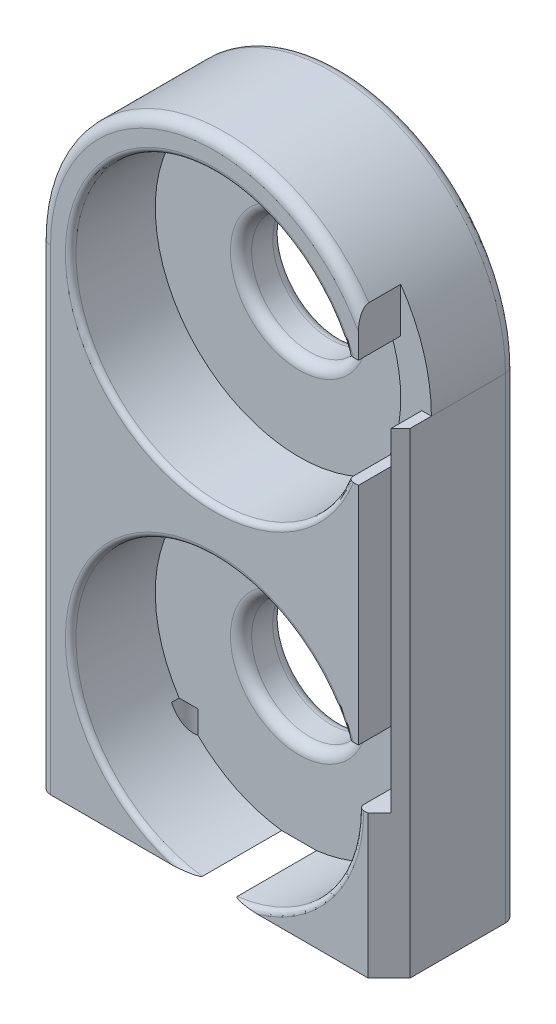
ISO-10303-21;
HEADER;
FILE_DESCRIPTION(('STEP AP214'),'2;1');
FILE_NAME('part.step','',(''),(''),'','','');
FILE_SCHEMA(('AUTOMOTIVE_DESIGN { 1 0 10303 214 1 1 1 1 }'));
ENDSEC;
DATA;
#1=APPLICATION_CONTEXT('core data for automotive mechanical design processes');
#2=APPLICATION_PROTOCOL_DEFINITION('international standard','automotive_design',2000,#1);
#3=PRODUCT_CONTEXT('',#1,'mechanical');
#4=PRODUCT('Part','Part','',(#3));
#5=PRODUCT_RELATED_PRODUCT_CATEGORY('part','',(#4));
#6=PRODUCT_DEFINITION_FORMATION('','',#4);
#7=PRODUCT_DEFINITION_CONTEXT('part definition',#1,'design');
#8=PRODUCT_DEFINITION('design','',#6,#7);
#9=PRODUCT_DEFINITION_SHAPE('','',#8);
#10=(LENGTH_UNIT() NAMED_UNIT(*) SI_UNIT(.MILLI.,.METRE.));
#11=(NAMED_UNIT(*) PLANE_ANGLE_UNIT() SI_UNIT($,.RADIAN.));
#12=(NAMED_UNIT(*) SI_UNIT($,.STERADIAN.) SOLID_ANGLE_UNIT());
#13=UNCERTAINTY_MEASURE_WITH_UNIT(LENGTH_MEASURE(1.E-05),#10,'distance_accuracy_value','');
#14=(GEOMETRIC_REPRESENTATION_CONTEXT(3) GLOBAL_UNCERTAINTY_ASSIGNED_CONTEXT((#13)) GLOBAL_UNIT_ASSIGNED_CONTEXT((#10,
#11,#12)) REPRESENTATION_CONTEXT('',''));
#15=CARTESIAN_POINT('',(0.,0.,0.));
#16=DIRECTION('',(0.,0.,1.));
#17=DIRECTION('',(1.,0.,0.));
#18=AXIS2_PLACEMENT_3D('',#15,#16,#17);
#19=CARTESIAN_POINT('',(0.,45.,12.));
#20=DIRECTION('',(0.,0.,-1.));
#21=DIRECTION('',(-1.,0.,0.));
#22=AXIS2_PLACEMENT_3D('',#19,#20,#21);
#23=PLANE('',#22);
#24=DIRECTION('',(1.,0.,0.));
#25=VECTOR('',#24,1.);
#26=CARTESIAN_POINT('',(-16.4999999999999,0.,12.));
#27=LINE('',#26,#25);
#28=CARTESIAN_POINT('',(-15.5,0.,12.));
#29=VERTEX_POINT('',#28);
#30=CARTESIAN_POINT('',(-4.06939798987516,0.,12.));
#31=VERTEX_POINT('',#30);
#32=EDGE_CURVE('E411',#29,#31,#27,.T.);
#33=ORIENTED_EDGE('',*,*,#32,.T.);
#34=CARTESIAN_POINT('',(0.,13.5,12.));
#35=DIRECTION('',(0.,0.,-1.));
#36=DIRECTION('',(-1.,0.,0.));
#37=AXIS2_PLACEMENT_3D('',#34,#35,#36);
#38=CIRCLE('',#37,14.1);
#39=CARTESIAN_POINT('',(13.1381124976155,18.6185935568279,12.));
#40=VERTEX_POINT('',#39);
#41=EDGE_CURVE('E711',#31,#40,#38,.T.);
#42=ORIENTED_EDGE('',*,*,#41,.T.);
#43=DIRECTION('',(-1.,0.,0.));
#44=VECTOR('',#43,1.);
#45=CARTESIAN_POINT('',(13.6,18.6185935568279,12.));
#46=LINE('',#45,#44);
#47=CARTESIAN_POINT('',(13.6,18.6185935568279,12.));
#48=VERTEX_POINT('',#47);
#49=EDGE_CURVE('E348',#48,#40,#46,.T.);
#50=ORIENTED_EDGE('',*,*,#49,.F.);
#51=DIRECTION('',(0.,-1.,0.));
#52=VECTOR('',#51,1.);
#53=CARTESIAN_POINT('',(13.6,39.8814064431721,12.));
#54=LINE('',#53,#52);
#55=CARTESIAN_POINT('',(13.6,39.8814064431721,12.));
#56=VERTEX_POINT('',#55);
#57=EDGE_CURVE('E344',#56,#48,#54,.T.);
#58=ORIENTED_EDGE('',*,*,#57,.F.);
#59=DIRECTION('',(1.,0.,0.));
#60=VECTOR('',#59,1.);
#61=CARTESIAN_POINT('',(12.6,39.8814064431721,12.));
#62=LINE('',#61,#60);
#63=CARTESIAN_POINT('',(13.1381124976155,39.8814064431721,12.));
#64=VERTEX_POINT('',#63);
#65=EDGE_CURVE('E341',#64,#56,#62,.T.);
#66=ORIENTED_EDGE('',*,*,#65,.F.);
#67=CARTESIAN_POINT('',(0.,45.,12.));
#68=DIRECTION('',(0.,0.,-1.));
#69=DIRECTION('',(-1.,0.,0.));
#70=AXIS2_PLACEMENT_3D('',#67,#68,#69);
#71=CIRCLE('',#70,14.1);
#72=CARTESIAN_POINT('',(13.1381124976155,50.1185935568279,12.));
#73=VERTEX_POINT('',#72);
#74=EDGE_CURVE('E744',#64,#73,#71,.T.);
#75=ORIENTED_EDGE('',*,*,#74,.T.);
#76=DIRECTION('',(-1.,0.,0.));
#77=VECTOR('',#76,1.);
#78=CARTESIAN_POINT('',(12.6,50.1185935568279,12.));
#79=LINE('',#78,#77);
#80=CARTESIAN_POINT('',(13.6,50.1185935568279,12.));
#81=VERTEX_POINT('',#80);
#82=EDGE_CURVE('E336',#81,#73,#79,.T.);
#83=ORIENTED_EDGE('',*,*,#82,.F.);
#84=DIRECTION('',(0.,-1.,0.));
#85=VECTOR('',#84,1.);
#86=CARTESIAN_POINT('',(13.6,54.3429117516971,12.));
#87=LINE('',#86,#85);
#88=CARTESIAN_POINT('',(13.6,52.4357245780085,12.));
#89=VERTEX_POINT('',#88);
#90=EDGE_CURVE('E333',#89,#81,#87,.T.);
#91=ORIENTED_EDGE('',*,*,#90,.F.);
#92=CARTESIAN_POINT('',(0.,45.,12.));
#93=DIRECTION('',(0.,0.,-1.));
#94=DIRECTION('',(-1.,0.,0.));
#95=AXIS2_PLACEMENT_3D('',#92,#93,#94);
#96=CIRCLE('',#95,15.5);
#97=CARTESIAN_POINT('',(-15.5,45.,12.));
#98=VERTEX_POINT('',#97);
#99=EDGE_CURVE('E447',#89,#98,#96,.F.);
#100=ORIENTED_EDGE('',*,*,#99,.T.);
#101=DIRECTION('',(0.,-1.,0.));
#102=VECTOR('',#101,1.);
#103=CARTESIAN_POINT('',(-15.5,45.,12.));
#104=LINE('',#103,#102);
#105=EDGE_CURVE('E450',#98,#29,#104,.T.);
#106=ORIENTED_EDGE('',*,*,#105,.T.);
#107=EDGE_LOOP('',(#33,#42,#50,#58,#66,#75,#83,#91,#100,#106));
#108=FACE_BOUND('',#107,.T.);
#109=ADVANCED_FACE('F46',(#108),#23,.F.);
#110=CARTESIAN_POINT('',(0.,45.,12.));
#111=DIRECTION('',(0.,0.,-1.));
#112=DIRECTION('',(-1.,0.,0.));
#113=AXIS2_PLACEMENT_3D('',#110,#111,#112);
#114=CYLINDRICAL_SURFACE('',#113,5.5);
#115=CARTESIAN_POINT('',(0.,45.,3.));
#116=DIRECTION('',(0.,0.,1.));
#117=DIRECTION('',(1.,0.,0.));
#118=AXIS2_PLACEMENT_3D('',#115,#116,#117);
#119=CIRCLE('',#118,5.5);
#120=CARTESIAN_POINT('',(5.5,45.,3.));
#121=VERTEX_POINT('',#120);
#122=EDGE_CURVE('E501',#121,#121,#119,.T.);
#123=ORIENTED_EDGE('',*,*,#122,.T.);
#124=EDGE_LOOP('',(#123));
#125=FACE_BOUND('',#124,.T.);
#126=CARTESIAN_POINT('',(0.,45.,1.));
#127=DIRECTION('',(0.,0.,-1.));
#128=DIRECTION('',(-1.,0.,0.));
#129=AXIS2_PLACEMENT_3D('',#126,#127,#128);
#130=CIRCLE('',#129,5.5);
#131=CARTESIAN_POINT('',(-5.5,45.,1.));
#132=VERTEX_POINT('',#131);
#133=EDGE_CURVE('E497',#132,#132,#130,.T.);
#134=ORIENTED_EDGE('',*,*,#133,.T.);
#135=EDGE_LOOP('',(#134));
#136=FACE_BOUND('',#135,.T.);
#137=ADVANCED_FACE('F570',(#125,#136),#114,.F.);
#138=CARTESIAN_POINT('',(0.,13.5,12.));
#139=DIRECTION('',(0.,0.,-1.));
#140=DIRECTION('',(-1.,0.,0.));
#141=AXIS2_PLACEMENT_3D('',#138,#139,#140);
#142=CYLINDRICAL_SURFACE('',#141,5.5);
#143=CARTESIAN_POINT('',(0.,13.5,3.));
#144=DIRECTION('',(0.,0.,1.));
#145=DIRECTION('',(1.,0.,0.));
#146=AXIS2_PLACEMENT_3D('',#143,#144,#145);
#147=CIRCLE('',#146,5.5);
#148=CARTESIAN_POINT('',(5.5,13.5,3.));
#149=VERTEX_POINT('',#148);
#150=EDGE_CURVE('E513',#149,#149,#147,.T.);
#151=ORIENTED_EDGE('',*,*,#150,.T.);
#152=EDGE_LOOP('',(#151));
#153=FACE_BOUND('',#152,.T.);
#154=CARTESIAN_POINT('',(0.,13.5,1.));
#155=DIRECTION('',(0.,0.,-1.));
#156=DIRECTION('',(-1.,0.,0.));
#157=AXIS2_PLACEMENT_3D('',#154,#155,#156);
#158=CIRCLE('',#157,5.5);
#159=CARTESIAN_POINT('',(-5.5,13.5,1.));
#160=VERTEX_POINT('',#159);
#161=EDGE_CURVE('E509',#160,#160,#158,.T.);
#162=ORIENTED_EDGE('',*,*,#161,.T.);
#163=EDGE_LOOP('',(#162));
#164=FACE_BOUND('',#163,.T.);
#165=ADVANCED_FACE('F577',(#153,#164),#142,.F.);
#166=CARTESIAN_POINT('',(4.06939798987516,0.,12.));
#167=VERTEX_POINT('',#166);
#168=CARTESIAN_POINT('',(14.5,0.,12.));
#169=VERTEX_POINT('',#168);
#170=EDGE_CURVE('E416',#167,#169,#27,.T.);
#171=ORIENTED_EDGE('',*,*,#170,.T.);
#172=DIRECTION('',(0.,1.,0.));
#173=VECTOR('',#172,1.);
#174=CARTESIAN_POINT('',(14.5,45.,12.));
#175=LINE('',#174,#173);
#176=CARTESIAN_POINT('',(14.5,13.5,12.));
#177=VERTEX_POINT('',#176);
#178=EDGE_CURVE('E596',#169,#177,#175,.T.);
#179=ORIENTED_EDGE('',*,*,#178,.T.);
#180=DIRECTION('',(1.,0.,0.));
#181=VECTOR('',#180,1.);
#182=CARTESIAN_POINT('',(12.6,13.5,12.));
#183=LINE('',#182,#181);
#184=CARTESIAN_POINT('',(14.1,13.5,12.));
#185=VERTEX_POINT('',#184);
#186=EDGE_CURVE('E352',#185,#177,#183,.T.);
#187=ORIENTED_EDGE('',*,*,#186,.F.);
#188=CARTESIAN_POINT('',(0.,13.5,12.));
#189=DIRECTION('',(0.,0.,-1.));
#190=DIRECTION('',(-1.,0.,0.));
#191=AXIS2_PLACEMENT_3D('',#188,#189,#190);
#192=CIRCLE('',#191,14.1);
#193=EDGE_CURVE('E598',#185,#167,#192,.T.);
#194=ORIENTED_EDGE('',*,*,#193,.T.);
#195=EDGE_LOOP('',(#171,#179,#187,#194));
#196=FACE_BOUND('',#195,.T.);
#197=ADVANCED_FACE('F573',(#196),#23,.F.);
#198=CARTESIAN_POINT('',(0.,45.,0.));
#199=DIRECTION('',(0.,0.,-1.));
#200=DIRECTION('',(-1.,0.,0.));
#201=AXIS2_PLACEMENT_3D('',#198,#199,#200);
#202=PLANE('',#201);
#203=CARTESIAN_POINT('',(0.,45.,0.));
#204=DIRECTION('',(0.,0.,-1.));
#205=DIRECTION('',(-1.,0.,0.));
#206=AXIS2_PLACEMENT_3D('',#203,#204,#205);
#207=CIRCLE('',#206,6.5);
#208=CARTESIAN_POINT('',(-6.5,45.,0.));
#209=VERTEX_POINT('',#208);
#210=EDGE_CURVE('E487',#209,#209,#207,.F.);
#211=ORIENTED_EDGE('',*,*,#210,.T.);
#212=EDGE_LOOP('',(#211));
#213=FACE_BOUND('',#212,.T.);
#214=CARTESIAN_POINT('',(0.,13.5,0.));
#215=DIRECTION('',(0.,0.,-1.));
#216=DIRECTION('',(-1.,0.,0.));
#217=AXIS2_PLACEMENT_3D('',#214,#215,#216);
#218=CIRCLE('',#217,6.5);
#219=CARTESIAN_POINT('',(-6.5,13.5,0.));
#220=VERTEX_POINT('',#219);
#221=EDGE_CURVE('E483',#220,#220,#218,.F.);
#222=ORIENTED_EDGE('',*,*,#221,.T.);
#223=EDGE_LOOP('',(#222));
#224=FACE_BOUND('',#223,.T.);
#225=CARTESIAN_POINT('',(0.,45.,0.));
#226=DIRECTION('',(0.,0.,-1.));
#227=DIRECTION('',(-1.,0.,0.));
#228=AXIS2_PLACEMENT_3D('',#225,#226,#227);
#229=CIRCLE('',#228,15.5);
#230=CARTESIAN_POINT('',(-15.5,45.,0.));
#231=VERTEX_POINT('',#230);
#232=CARTESIAN_POINT('',(15.5,45.,0.));
#233=VERTEX_POINT('',#232);
#234=EDGE_CURVE('E477',#231,#233,#229,.T.);
#235=ORIENTED_EDGE('',*,*,#234,.T.);
#236=DIRECTION('',(0.,1.,0.));
#237=VECTOR('',#236,1.);
#238=CARTESIAN_POINT('',(15.5,0.,0.));
#239=LINE('',#238,#237);
#240=CARTESIAN_POINT('',(15.5,0.,0.));
#241=VERTEX_POINT('',#240);
#242=EDGE_CURVE('E480',#233,#241,#239,.F.);
#243=ORIENTED_EDGE('',*,*,#242,.T.);
#244=DIRECTION('',(1.,0.,0.));
#245=VECTOR('',#244,1.);
#246=CARTESIAN_POINT('',(-16.4999999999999,0.,0.));
#247=LINE('',#246,#245);
#248=CARTESIAN_POINT('',(-15.5,0.,0.));
#249=VERTEX_POINT('',#248);
#250=EDGE_CURVE('E410',#249,#241,#247,.T.);
#251=ORIENTED_EDGE('',*,*,#250,.F.);
#252=DIRECTION('',(0.,-1.,0.));
#253=VECTOR('',#252,1.);
#254=CARTESIAN_POINT('',(-15.5,45.,0.));
#255=LINE('',#254,#253);
#256=EDGE_CURVE('E474',#249,#231,#255,.F.);
#257=ORIENTED_EDGE('',*,*,#256,.T.);
#258=EDGE_LOOP('',(#235,#243,#251,#257));
#259=FACE_BOUND('',#258,.T.);
#260=ADVANCED_FACE('F582',(#213,#224,#259),#202,.T.);
#261=CARTESIAN_POINT('',(-16.4999999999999,0.,12.));
#262=DIRECTION('',(0.,1.,0.));
#263=DIRECTION('',(0.,0.,1.));
#264=AXIS2_PLACEMENT_3D('',#261,#262,#263);
#265=PLANE('',#264);
#266=CARTESIAN_POINT('',(-11.,0.,3.));
#267=DIRECTION('',(0.,-1.,0.));
#268=DIRECTION('',(0.,0.,-1.));
#269=AXIS2_PLACEMENT_3D('',#266,#267,#268);
#270=CIRCLE('',#269,1.75);
#271=CARTESIAN_POINT('',(-11.,0.,1.25));
#272=VERTEX_POINT('',#271);
#273=EDGE_CURVE('E654',#272,#272,#270,.T.);
#274=ORIENTED_EDGE('',*,*,#273,.F.);
#275=EDGE_LOOP('',(#274));
#276=FACE_BOUND('',#275,.T.);
#277=CARTESIAN_POINT('',(11.,0.,3.));
#278=DIRECTION('',(0.,-1.,0.));
#279=DIRECTION('',(0.,0.,-1.));
#280=AXIS2_PLACEMENT_3D('',#277,#278,#279);
#281=CIRCLE('',#280,1.75);
#282=CARTESIAN_POINT('',(11.,0.,1.25));
#283=VERTEX_POINT('',#282);
#284=EDGE_CURVE('E252',#283,#283,#281,.T.);
#285=ORIENTED_EDGE('',*,*,#284,.F.);
#286=EDGE_LOOP('',(#285));
#287=FACE_BOUND('',#286,.T.);
#288=CARTESIAN_POINT('',(14.,0.,9.00000000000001));
#289=DIRECTION('',(0.,-1.,0.));
#290=DIRECTION('',(0.,0.,-1.));
#291=AXIS2_PLACEMENT_3D('',#288,#289,#290);
#292=CIRCLE('',#291,1.75);
#293=CARTESIAN_POINT('',(14.,0.,7.25000000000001));
#294=VERTEX_POINT('',#293);
#295=EDGE_CURVE('E251',#294,#294,#292,.T.);
#296=ORIENTED_EDGE('',*,*,#295,.F.);
#297=EDGE_LOOP('',(#296));
#298=FACE_BOUND('',#297,.T.);
#299=CARTESIAN_POINT('',(-14.,0.,9.));
#300=DIRECTION('',(0.,-1.,0.));
#301=DIRECTION('',(0.,0.,-1.));
#302=AXIS2_PLACEMENT_3D('',#299,#300,#301);
#303=CIRCLE('',#302,1.75);
#304=CARTESIAN_POINT('',(-14.,0.,7.25));
#305=VERTEX_POINT('',#304);
#306=EDGE_CURVE('E265',#305,#305,#303,.T.);
#307=ORIENTED_EDGE('',*,*,#306,.F.);
#308=EDGE_LOOP('',(#307));
#309=FACE_BOUND('',#308,.T.);
#310=DIRECTION('',(0.,0.,-1.));
#311=VECTOR('',#310,1.);
#312=CARTESIAN_POINT('',(16.5000000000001,0.,12.));
#313=LINE('',#312,#311);
#314=CARTESIAN_POINT('',(16.5000000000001,0.,9.99999999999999));
#315=VERTEX_POINT('',#314);
#316=CARTESIAN_POINT('',(16.5000000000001,0.,1.));
#317=VERTEX_POINT('',#316);
#318=EDGE_CURVE('E431',#315,#317,#313,.T.);
#319=ORIENTED_EDGE('',*,*,#318,.F.);
#320=DIRECTION('',(0.707106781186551,0.,-0.707106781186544));
#321=VECTOR('',#320,1.);
#322=CARTESIAN_POINT('',(14.5,0.,12.));
#323=LINE('',#322,#321);
#324=EDGE_CURVE('E13',#315,#169,#323,.F.);
#325=ORIENTED_EDGE('',*,*,#324,.T.);
#326=ORIENTED_EDGE('',*,*,#170,.F.);
#327=CARTESIAN_POINT('',(4.06939798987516,0.,12.));
#328=CARTESIAN_POINT('',(3.98575945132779,0.,11.9999729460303));
#329=CARTESIAN_POINT('',(3.90213684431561,0.,11.9982530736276));
#330=CARTESIAN_POINT('',(3.73502141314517,0.,11.9918039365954));
#331=CARTESIAN_POINT('',(3.65152856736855,0.,11.9870752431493));
#332=CARTESIAN_POINT('',(3.48478037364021,0.,11.9749874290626));
#333=CARTESIAN_POINT('',(3.40152492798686,0.,11.9676296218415));
#334=CARTESIAN_POINT('',(3.23526198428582,0.,11.9505008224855));
#335=CARTESIAN_POINT('',(3.15225449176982,0.,11.9407297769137));
#336=CARTESIAN_POINT('',(2.98841626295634,0.,11.9191419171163));
#337=CARTESIAN_POINT('',(2.90757877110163,0.,11.9073763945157));
#338=CARTESIAN_POINT('',(2.74626292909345,0.,11.8816267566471));
#339=CARTESIAN_POINT('',(2.66578456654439,0.,11.8676427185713));
#340=CARTESIAN_POINT('',(2.47642056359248,0.,11.8318303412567));
#341=CARTESIAN_POINT('',(2.36772024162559,0.,11.8089890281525));
#342=CARTESIAN_POINT('',(2.18660266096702,0.,11.7654530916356));
#343=CARTESIAN_POINT('',(2.11378873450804,0.,11.7464414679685));
#344=CARTESIAN_POINT('',(1.99273237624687,0.,11.7105412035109));
#345=CARTESIAN_POINT('',(1.94412280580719,0.,11.6949380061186));
#346=CARTESIAN_POINT('',(1.86354943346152,0.,11.6654072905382));
#347=CARTESIAN_POINT('',(1.83121175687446,0.,11.6525270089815));
#348=CARTESIAN_POINT('',(1.77781063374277,0.,11.6279710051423));
#349=CARTESIAN_POINT('',(1.75637064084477,0.,11.6171680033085));
#350=CARTESIAN_POINT('',(1.72496559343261,0.,11.5984909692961));
#351=CARTESIAN_POINT('',(1.71438577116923,0.,11.5916618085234));
#352=CARTESIAN_POINT('',(1.69409651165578,0.,11.5768077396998));
#353=CARTESIAN_POINT('',(1.68438369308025,0.,11.568787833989));
#354=CARTESIAN_POINT('',(1.67210267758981,0.,11.5562230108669));
#355=CARTESIAN_POINT('',(1.66873634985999,0.,11.5524693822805));
#356=CARTESIAN_POINT('',(1.66245920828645,0.,11.5445894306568));
#357=CARTESIAN_POINT('',(1.65954833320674,0.,11.5404631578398));
#358=CARTESIAN_POINT('',(1.65484054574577,0.,11.5325467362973));
#359=CARTESIAN_POINT('',(1.65293820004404,0.,11.5288203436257));
#360=CARTESIAN_POINT('',(1.64976690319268,0.,11.521112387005));
#361=CARTESIAN_POINT('',(1.64849554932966,0.,11.5171318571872));
#362=CARTESIAN_POINT('',(1.6471559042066,0.,11.5109264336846));
#363=CARTESIAN_POINT('',(1.64680300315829,0.,11.508761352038));
#364=CARTESIAN_POINT('',(1.64632781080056,0.,11.5043982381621));
#365=CARTESIAN_POINT('',(1.64620636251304,0.,11.5022001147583));
#366=CARTESIAN_POINT('',(1.64620776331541,0.,11.5));
#367=B_SPLINE_CURVE_WITH_KNOTS('',3,(#327,#328,#329,#330,#331,#332,#333,#334,#335,#336,#337,
#338,#339,#340,#341,#342,#343,#344,#345,#346,#347,#348,#349,#350,#351,#352,#353,#354,#355,#356,
#357,#358,#359,#360,#361,#362,#363,#364,#365,#366),.UNSPECIFIED.,.F.,.F.,(4,2,2,2,2,2,2,2,2,2,2,
2,2,2,2,2,2,2,2,4),(0.,0.250876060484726,0.501704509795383,0.752407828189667,1.00311669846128,
1.24815283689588,1.49318045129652,1.82626796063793,2.05194353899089,2.20499970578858,
2.30934237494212,2.38121080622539,2.41895442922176,2.45654375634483,2.47164617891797,
2.48674656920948,2.49925670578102,2.51171883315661,2.51828843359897,2.52488191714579),.UNSPECIFIED.);
#368=CARTESIAN_POINT('',(1.64620776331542,0.,11.5));
#369=VERTEX_POINT('',#368);
#370=EDGE_CURVE('E746',#167,#369,#367,.T.);
#371=ORIENTED_EDGE('',*,*,#370,.T.);
#372=DIRECTION('',(0.,0.,1.));
#373=VECTOR('',#372,1.);
#374=CARTESIAN_POINT('',(1.64620776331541,0.,4.));
#375=LINE('',#374,#373);
#376=CARTESIAN_POINT('',(1.64620776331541,0.,4.));
#377=VERTEX_POINT('',#376);
#378=EDGE_CURVE('E434',#369,#377,#375,.F.);
#379=ORIENTED_EDGE('',*,*,#378,.T.);
#380=DIRECTION('',(1.,0.,0.));
#381=VECTOR('',#380,1.);
#382=CARTESIAN_POINT('',(-16.4999999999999,0.,4.));
#383=LINE('',#382,#381);
#384=CARTESIAN_POINT('',(-1.64620776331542,0.,4.));
#385=VERTEX_POINT('',#384);
#386=EDGE_CURVE('E403',#385,#377,#383,.T.);
#387=ORIENTED_EDGE('',*,*,#386,.F.);
#388=DIRECTION('',(0.,0.,1.));
#389=VECTOR('',#388,1.);
#390=CARTESIAN_POINT('',(-1.64620776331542,0.,4.));
#391=LINE('',#390,#389);
#392=CARTESIAN_POINT('',(-1.64620776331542,0.,11.5));
#393=VERTEX_POINT('',#392);
#394=EDGE_CURVE('E437',#385,#393,#391,.T.);
#395=ORIENTED_EDGE('',*,*,#394,.T.);
#396=CARTESIAN_POINT('',(-1.64620776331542,0.,11.5));
#397=CARTESIAN_POINT('',(-1.64619376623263,0.,11.5040029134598));
#398=CARTESIAN_POINT('',(-1.64660428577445,0.,11.5079847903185));
#399=CARTESIAN_POINT('',(-1.64813718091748,0.,11.515747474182));
#400=CARTESIAN_POINT('',(-1.64924831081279,0.,11.5195304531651));
#401=CARTESIAN_POINT('',(-1.65247455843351,0.,11.5279713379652));
#402=CARTESIAN_POINT('',(-1.65479115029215,0.,11.5325500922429));
#403=CARTESIAN_POINT('',(-1.66011507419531,0.,11.5413120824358));
#404=CARTESIAN_POINT('',(-1.66312713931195,0.,11.5454923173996));
#405=CARTESIAN_POINT('',(-1.67252297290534,0.,11.5570742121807));
#406=CARTESIAN_POINT('',(-1.67949994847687,0.,11.5639859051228));
#407=CARTESIAN_POINT('',(-1.69426483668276,0.,11.5768476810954));
#408=CARTESIAN_POINT('',(-1.70205454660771,0.,11.5827955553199));
#409=CARTESIAN_POINT('',(-1.72504004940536,0.,11.5988869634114));
#410=CARTESIAN_POINT('',(-1.74080765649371,0.,11.6082033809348));
#411=CARTESIAN_POINT('',(-1.77306671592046,0.,11.6255074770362));
#412=CARTESIAN_POINT('',(-1.78956008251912,0.,11.6334913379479));
#413=CARTESIAN_POINT('',(-1.82304833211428,0.,11.6485983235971));
#414=CARTESIAN_POINT('',(-1.84004552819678,0.,11.6557163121));
#415=CARTESIAN_POINT('',(-1.87427100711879,0.,11.6692859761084));
#416=CARTESIAN_POINT('',(-1.89149892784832,0.,11.6757385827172));
#417=CARTESIAN_POINT('',(-1.9430354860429,0.,11.6942130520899));
#418=CARTESIAN_POINT('',(-1.97759904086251,0.,11.7055218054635));
#419=CARTESIAN_POINT('',(-2.047114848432,0.,11.7268839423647));
#420=CARTESIAN_POINT('',(-2.08206723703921,0.,11.7369368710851));
#421=CARTESIAN_POINT('',(-2.18739778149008,0.,11.7657455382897));
#422=CARTESIAN_POINT('',(-2.25815309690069,0.,11.7831193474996));
#423=CARTESIAN_POINT('',(-2.39999197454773,0.,11.8153768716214));
#424=CARTESIAN_POINT('',(-2.47107394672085,0.,11.8302678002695));
#425=CARTESIAN_POINT('',(-2.61357193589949,0.,11.8580593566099));
#426=CARTESIAN_POINT('',(-2.68498767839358,0.,11.8709613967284));
#427=CARTESIAN_POINT('',(-2.86514744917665,0.,11.9012158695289));
#428=CARTESIAN_POINT('',(-2.97408595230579,0.,11.9174167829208));
#429=CARTESIAN_POINT('',(-3.19250789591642,0.,11.9458488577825));
#430=CARTESIAN_POINT('',(-3.30199147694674,0.,11.958078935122));
#431=CARTESIAN_POINT('',(-3.52101006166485,0.,11.9782059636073));
#432=CARTESIAN_POINT('',(-3.63054374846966,0.,11.9861168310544));
#433=CARTESIAN_POINT('',(-3.79501758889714,0.,11.9942859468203));
#434=CARTESIAN_POINT('',(-3.84986829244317,0.,11.9963927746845));
#435=CARTESIAN_POINT('',(-3.95961031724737,0.,11.9992475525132));
#436=CARTESIAN_POINT('',(-4.01450164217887,0.,11.9999953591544));
#437=CARTESIAN_POINT('',(-4.06939798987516,0.,12.));
#438=B_SPLINE_CURVE_WITH_KNOTS('',3,(#396,#397,#398,#399,#400,#401,#402,#403,#404,#405,#406,
#407,#408,#409,#410,#411,#412,#413,#414,#415,#416,#417,#418,#419,#420,#421,#422,#423,#424,#425,
#426,#427,#428,#429,#430,#431,#432,#433,#434,#435,#436,#437),.UNSPECIFIED.,.F.,.F.,(4,2,2,2,2,2,
2,2,2,2,2,2,2,2,2,2,2,2,2,2,4),(0.,0.0119540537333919,0.0237209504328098,0.0390276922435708,
0.0544418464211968,0.0837404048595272,0.113105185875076,0.167899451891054,0.222848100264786,
0.278108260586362,0.33329001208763,0.442345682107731,0.551440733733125,0.769934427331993,
0.987781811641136,1.20547376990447,1.5358054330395,1.86622720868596,2.19557800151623,
2.36023664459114,2.5249126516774),.UNSPECIFIED.);
#439=EDGE_CURVE('E693',#393,#31,#438,.T.);
#440=ORIENTED_EDGE('',*,*,#439,.T.);
#441=ORIENTED_EDGE('',*,*,#32,.F.);
#442=CARTESIAN_POINT('',(-15.5,0.,11.));
#443=DIRECTION('',(0.,1.,0.));
#444=DIRECTION('',(0.,0.,1.));
#445=AXIS2_PLACEMENT_3D('',#442,#443,#444);
#446=CIRCLE('',#445,1.);
#447=CARTESIAN_POINT('',(-16.4999999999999,0.,11.));
#448=VERTEX_POINT('',#447);
#449=EDGE_CURVE('E461',#29,#448,#446,.F.);
#450=ORIENTED_EDGE('',*,*,#449,.T.);
#451=DIRECTION('',(0.,0.,-1.));
#452=VECTOR('',#451,1.);
#453=CARTESIAN_POINT('',(-16.4999999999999,0.,12.));
#454=LINE('',#453,#452);
#455=CARTESIAN_POINT('',(-16.4999999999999,0.,1.));
#456=VERTEX_POINT('',#455);
#457=EDGE_CURVE('E415',#448,#456,#454,.T.);
#458=ORIENTED_EDGE('',*,*,#457,.T.);
#459=CARTESIAN_POINT('',(-15.5,0.,1.));
#460=DIRECTION('',(0.,1.,0.));
#461=DIRECTION('',(0.,0.,1.));
#462=AXIS2_PLACEMENT_3D('',#459,#460,#461);
#463=CIRCLE('',#462,1.);
#464=EDGE_CURVE('E454',#456,#249,#463,.F.);
#465=ORIENTED_EDGE('',*,*,#464,.T.);
#466=ORIENTED_EDGE('',*,*,#250,.T.);
#467=CARTESIAN_POINT('',(15.5,0.,1.));
#468=DIRECTION('',(0.,1.,0.));
#469=DIRECTION('',(0.,0.,1.));
#470=AXIS2_PLACEMENT_3D('',#467,#468,#469);
#471=CIRCLE('',#470,1.);
#472=EDGE_CURVE('E457',#241,#317,#471,.F.);
#473=ORIENTED_EDGE('',*,*,#472,.T.);
#474=EDGE_LOOP('',(#319,#325,#326,#371,#379,#387,#395,#440,#441,#450,#458,#465,#466,#473));
#475=FACE_BOUND('',#474,.T.);
#476=ADVANCED_FACE('F588',(#276,#287,#298,#309,#475),#265,.F.);
#477=CARTESIAN_POINT('',(16.5000000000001,45.,12.));
#478=DIRECTION('',(-1.,0.,0.));
#479=DIRECTION('',(0.,-1.,0.));
#480=AXIS2_PLACEMENT_3D('',#477,#478,#479);
#481=PLANE('',#480);
#482=DIRECTION('',(0.,0.,-1.));
#483=VECTOR('',#482,1.);
#484=CARTESIAN_POINT('',(16.5000000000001,45.,12.));
#485=LINE('',#484,#483);
#486=CARTESIAN_POINT('',(16.5000000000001,45.,9.99999999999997));
#487=VERTEX_POINT('',#486);
#488=CARTESIAN_POINT('',(16.5000000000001,45.,8.));
#489=VERTEX_POINT('',#488);
#490=EDGE_CURVE('E428',#487,#489,#485,.T.);
#491=ORIENTED_EDGE('',*,*,#490,.F.);
#492=DIRECTION('',(0.,-1.,0.));
#493=VECTOR('',#492,1.);
#494=CARTESIAN_POINT('',(16.5000000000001,45.,9.99999999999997));
#495=LINE('',#494,#493);
#496=EDGE_CURVE('E56',#487,#315,#495,.T.);
#497=ORIENTED_EDGE('',*,*,#496,.T.);
#498=ORIENTED_EDGE('',*,*,#318,.T.);
#499=DIRECTION('',(0.,1.,0.));
#500=VECTOR('',#499,1.);
#501=CARTESIAN_POINT('',(16.5000000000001,45.,1.));
#502=LINE('',#501,#500);
#503=CARTESIAN_POINT('',(16.5000000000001,45.,1.));
#504=VERTEX_POINT('',#503);
#505=EDGE_CURVE('E470',#317,#504,#502,.T.);
#506=ORIENTED_EDGE('',*,*,#505,.T.);
#507=EDGE_CURVE('E427',#489,#504,#485,.T.);
#508=ORIENTED_EDGE('',*,*,#507,.F.);
#509=EDGE_LOOP('',(#491,#497,#498,#506,#508));
#510=FACE_BOUND('',#509,.T.);
#511=ADVANCED_FACE('F636',(#510),#481,.F.);
#512=CARTESIAN_POINT('',(0.,45.,12.));
#513=DIRECTION('',(0.,0.,-1.));
#514=DIRECTION('',(-1.,0.,0.));
#515=AXIS2_PLACEMENT_3D('',#512,#513,#514);
#516=CYLINDRICAL_SURFACE('',#515,16.5);
#517=ORIENTED_EDGE('',*,*,#507,.T.);
#518=CARTESIAN_POINT('',(0.,45.,1.));
#519=DIRECTION('',(0.,0.,-1.));
#520=DIRECTION('',(-1.,0.,0.));
#521=AXIS2_PLACEMENT_3D('',#518,#519,#520);
#522=CIRCLE('',#521,16.5);
#523=CARTESIAN_POINT('',(-16.4999999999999,45.,1.));
#524=VERTEX_POINT('',#523);
#525=EDGE_CURVE('E494',#504,#524,#522,.F.);
#526=ORIENTED_EDGE('',*,*,#525,.T.);
#527=DIRECTION('',(0.,0.,-1.));
#528=VECTOR('',#527,1.);
#529=CARTESIAN_POINT('',(-16.4999999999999,45.,12.));
#530=LINE('',#529,#528);
#531=CARTESIAN_POINT('',(-16.4999999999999,45.,11.));
#532=VERTEX_POINT('',#531);
#533=EDGE_CURVE('E423',#532,#524,#530,.T.);
#534=ORIENTED_EDGE('',*,*,#533,.F.);
#535=CARTESIAN_POINT('',(0.,45.,11.));
#536=DIRECTION('',(0.,0.,-1.));
#537=DIRECTION('',(-1.,0.,0.));
#538=AXIS2_PLACEMENT_3D('',#535,#536,#537);
#539=CIRCLE('',#538,16.5);
#540=CARTESIAN_POINT('',(13.6,54.3429117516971,11.));
#541=VERTEX_POINT('',#540);
#542=EDGE_CURVE('E491',#532,#541,#539,.T.);
#543=ORIENTED_EDGE('',*,*,#542,.T.);
#544=DIRECTION('',(0.,0.,1.));
#545=VECTOR('',#544,1.);
#546=CARTESIAN_POINT('',(13.6,54.3429117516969,-37.1478242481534));
#547=LINE('',#546,#545);
#548=CARTESIAN_POINT('',(13.5999999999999,54.3429117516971,8.));
#549=VERTEX_POINT('',#548);
#550=EDGE_CURVE('E379',#549,#541,#547,.T.);
#551=ORIENTED_EDGE('',*,*,#550,.F.);
#552=CARTESIAN_POINT('',(0.,45.,8.));
#553=DIRECTION('',(0.,0.,1.));
#554=DIRECTION('',(1.,0.,0.));
#555=AXIS2_PLACEMENT_3D('',#552,#553,#554);
#556=CIRCLE('',#555,16.5);
#557=EDGE_CURVE('E395',#489,#549,#556,.T.);
#558=ORIENTED_EDGE('',*,*,#557,.F.);
#559=EDGE_LOOP('',(#517,#526,#534,#543,#551,#558));
#560=FACE_BOUND('',#559,.T.);
#561=ADVANCED_FACE('F635',(#560),#516,.T.);
#562=CARTESIAN_POINT('',(-16.4999999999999,0.,12.));
#563=DIRECTION('',(1.,0.,0.));
#564=DIRECTION('',(0.,0.,-1.));
#565=AXIS2_PLACEMENT_3D('',#562,#563,#564);
#566=PLANE('',#565);
#567=ORIENTED_EDGE('',*,*,#457,.F.);
#568=DIRECTION('',(0.,-1.,0.));
#569=VECTOR('',#568,1.);
#570=CARTESIAN_POINT('',(-16.4999999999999,0.,11.));
#571=LINE('',#570,#569);
#572=EDGE_CURVE('E467',#448,#532,#571,.F.);
#573=ORIENTED_EDGE('',*,*,#572,.T.);
#574=ORIENTED_EDGE('',*,*,#533,.T.);
#575=DIRECTION('',(0.,-1.,0.));
#576=VECTOR('',#575,1.);
#577=CARTESIAN_POINT('',(-16.4999999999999,0.,1.));
#578=LINE('',#577,#576);
#579=EDGE_CURVE('E464',#524,#456,#578,.T.);
#580=ORIENTED_EDGE('',*,*,#579,.T.);
#581=EDGE_LOOP('',(#567,#573,#574,#580));
#582=FACE_BOUND('',#581,.T.);
#583=ADVANCED_FACE('F566',(#582),#566,.F.);
#584=CARTESIAN_POINT('',(0.,13.5,4.));
#585=DIRECTION('',(0.,0.,1.));
#586=DIRECTION('',(1.,0.,0.));
#587=AXIS2_PLACEMENT_3D('',#584,#585,#586);
#588=CYLINDRICAL_SURFACE('',#587,13.6);
#589=CARTESIAN_POINT('',(0.,13.5,4.));
#590=DIRECTION('',(0.,0.,1.));
#591=DIRECTION('',(1.,0.,0.));
#592=AXIS2_PLACEMENT_3D('',#589,#590,#591);
#593=CIRCLE('',#592,13.6);
#594=CARTESIAN_POINT('',(-9.56385933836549,3.83084313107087,4.));
#595=VERTEX_POINT('',#594);
#596=EDGE_CURVE('E398',#595,#385,#593,.T.);
#597=ORIENTED_EDGE('',*,*,#596,.F.);
#598=CARTESIAN_POINT('',(-9.56385933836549,3.83084313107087,4.));
#599=CARTESIAN_POINT('',(-9.59518986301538,3.86182820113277,4.04498726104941));
#600=CARTESIAN_POINT('',(-9.62800184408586,3.89458845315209,4.08761169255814));
#601=CARTESIAN_POINT('',(-9.69590758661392,3.96314092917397,4.16816738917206));
#602=CARTESIAN_POINT('',(-9.73099648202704,3.99892673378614,4.20610819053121));
#603=CARTESIAN_POINT('',(-9.83784761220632,4.10920118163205,4.31220602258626));
#604=CARTESIAN_POINT('',(-9.91211541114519,4.18750940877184,4.37390186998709));
#605=CARTESIAN_POINT('',(-10.0913514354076,4.38145852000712,4.50099445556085));
#606=CARTESIAN_POINT('',(-10.1976308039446,4.50029305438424,4.55952226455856));
#607=CARTESIAN_POINT('',(-10.4112490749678,4.74825418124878,4.65214185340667));
#608=CARTESIAN_POINT('',(-10.5185870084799,4.87747816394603,4.68596257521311));
#609=CARTESIAN_POINT('',(-10.6882339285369,5.08975542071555,4.7232466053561));
#610=CARTESIAN_POINT('',(-10.7515967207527,5.17090472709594,4.7334228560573));
#611=CARTESIAN_POINT('',(-10.8767595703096,5.33502954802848,4.74678991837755));
#612=CARTESIAN_POINT('',(-10.9385589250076,5.41800585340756,4.74997764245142));
#613=CARTESIAN_POINT('',(-11.0590105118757,5.5836522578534,4.7500217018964));
#614=CARTESIAN_POINT('',(-11.1177010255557,5.66629502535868,4.74700393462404));
#615=CARTESIAN_POINT('',(-11.2329763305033,5.83250432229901,4.7353839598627));
#616=CARTESIAN_POINT('',(-11.2895636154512,5.91606959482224,4.72678860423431));
#617=CARTESIAN_POINT('',(-11.3450429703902,6.00000000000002,4.71564720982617));
#618=B_SPLINE_CURVE_WITH_KNOTS('',3,(#598,#599,#600,#601,#602,#603,#604,#605,#606,#607,#608,
#609,#610,#611,#612,#613,#614,#615,#616,#617),.UNSPECIFIED.,.F.,.F.,(4,2,2,2,2,2,2,2,2,4),(0.,
0.188709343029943,0.377027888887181,0.748329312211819,1.25515867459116,1.76746814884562,
2.07760588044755,2.38788060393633,2.69192259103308,2.99559177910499),.UNSPECIFIED.);
#619=CARTESIAN_POINT('',(-11.3450429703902,6.00000000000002,4.71564720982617));
#620=VERTEX_POINT('',#619);
#621=EDGE_CURVE('E298',#595,#620,#618,.T.);
#622=ORIENTED_EDGE('',*,*,#621,.T.);
#623=DIRECTION('',(0.,0.,1.));
#624=VECTOR('',#623,1.);
#625=CARTESIAN_POINT('',(-11.3450429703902,6.00000000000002,4.));
#626=LINE('',#625,#624);
#627=CARTESIAN_POINT('',(-11.3450429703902,6.00000000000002,4.));
#628=VERTEX_POINT('',#627);
#629=EDGE_CURVE('E243',#628,#620,#626,.T.);
#630=ORIENTED_EDGE('',*,*,#629,.F.);
#631=CARTESIAN_POINT('',(11.3450429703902,6.00000000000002,4.00000000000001));
#632=VERTEX_POINT('',#631);
#633=EDGE_CURVE('E259',#632,#628,#593,.T.);
#634=ORIENTED_EDGE('',*,*,#633,.F.);
#635=DIRECTION('',(0.,0.,1.));
#636=VECTOR('',#635,1.);
#637=CARTESIAN_POINT('',(11.3450429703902,6.00000000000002,4.00000000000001));
#638=LINE('',#637,#636);
#639=CARTESIAN_POINT('',(11.3450429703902,6.00000000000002,4.71564720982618));
#640=VERTEX_POINT('',#639);
#641=EDGE_CURVE('E244',#640,#632,#638,.F.);
#642=ORIENTED_EDGE('',*,*,#641,.F.);
#643=CARTESIAN_POINT('',(11.3450429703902,6.00000000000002,4.71564720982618));
#644=CARTESIAN_POINT('',(11.3076414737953,5.94342319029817,4.72316612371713));
#645=CARTESIAN_POINT('',(11.269747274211,5.88702255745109,4.72951794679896));
#646=CARTESIAN_POINT('',(11.1930027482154,5.77463133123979,4.73975610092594));
#647=CARTESIAN_POINT('',(11.1541522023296,5.71864083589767,4.743641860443));
#648=CARTESIAN_POINT('',(11.0358981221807,5.55093068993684,4.7514207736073));
#649=CARTESIAN_POINT('',(10.9551146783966,5.43996056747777,4.75136846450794));
#650=CARTESIAN_POINT('',(10.7883667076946,5.2180374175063,4.73921930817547));
#651=CARTESIAN_POINT('',(10.7023219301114,5.10716076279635,4.72680744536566));
#652=CARTESIAN_POINT('',(10.5282765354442,4.88984864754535,4.68757702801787));
#653=CARTESIAN_POINT('',(10.4402805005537,4.78340418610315,4.66078937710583));
#654=CARTESIAN_POINT('',(10.2655996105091,4.57838343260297,4.5911726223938));
#655=CARTESIAN_POINT('',(10.1789221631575,4.479695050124,4.54866257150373));
#656=CARTESIAN_POINT('',(10.008642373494,4.29114586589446,4.44551160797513));
#657=CARTESIAN_POINT('',(9.92501763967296,4.20120506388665,4.38506068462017));
#658=CARTESIAN_POINT('',(9.79459025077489,4.06436168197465,4.27039831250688));
#659=CARTESIAN_POINT('',(9.74583191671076,4.01405540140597,4.22248736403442));
#660=CARTESIAN_POINT('',(9.65175221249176,3.91833510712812,4.1179040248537));
#661=CARTESIAN_POINT('',(9.60646560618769,3.87296903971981,4.06115687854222));
#662=CARTESIAN_POINT('',(9.56385933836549,3.83084313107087,3.99999999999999));
#663=B_SPLINE_CURVE_WITH_KNOTS('',3,(#643,#644,#645,#646,#647,#648,#649,#650,#651,#652,#653,
#654,#655,#656,#657,#658,#659,#660,#661,#662),.UNSPECIFIED.,.F.,.F.,(4,2,2,2,2,2,2,2,2,4),(0.,
0.204688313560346,0.409424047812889,0.820657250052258,1.24264716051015,1.66373353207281,
2.07670589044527,2.48545219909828,2.73946935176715,2.99576569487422),.UNSPECIFIED.);
#664=CARTESIAN_POINT('',(9.56385933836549,3.83084313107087,3.99999999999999));
#665=VERTEX_POINT('',#664);
#666=EDGE_CURVE('E232',#640,#665,#663,.T.);
#667=ORIENTED_EDGE('',*,*,#666,.T.);
#668=EDGE_CURVE('E404',#377,#665,#593,.T.);
#669=ORIENTED_EDGE('',*,*,#668,.F.);
#670=ORIENTED_EDGE('',*,*,#378,.F.);
#671=CARTESIAN_POINT('',(0.,13.5,11.5));
#672=DIRECTION('',(0.,0.,-1.));
#673=DIRECTION('',(-1.,0.,0.));
#674=AXIS2_PLACEMENT_3D('',#671,#672,#673);
#675=CIRCLE('',#674,13.6);
#676=CARTESIAN_POINT('',(13.6,13.5,11.5));
#677=VERTEX_POINT('',#676);
#678=EDGE_CURVE('E752',#369,#677,#675,.F.);
#679=ORIENTED_EDGE('',*,*,#678,.T.);
#680=DIRECTION('',(0.,0.,1.));
#681=VECTOR('',#680,1.);
#682=CARTESIAN_POINT('',(13.6,13.5,4.));
#683=LINE('',#682,#681);
#684=CARTESIAN_POINT('',(13.5999999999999,13.5,8.));
#685=VERTEX_POINT('',#684);
#686=EDGE_CURVE('E444',#677,#685,#683,.F.);
#687=ORIENTED_EDGE('',*,*,#686,.T.);
#688=CARTESIAN_POINT('',(0.,13.5,8.));
#689=DIRECTION('',(0.,0.,1.));
#690=DIRECTION('',(1.,0.,0.));
#691=AXIS2_PLACEMENT_3D('',#688,#689,#690);
#692=CIRCLE('',#691,13.6);
#693=CARTESIAN_POINT('',(12.5999999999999,18.6185935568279,8.));
#694=VERTEX_POINT('',#693);
#695=EDGE_CURVE('E391',#694,#685,#692,.F.);
#696=ORIENTED_EDGE('',*,*,#695,.F.);
#697=DIRECTION('',(0.,0.,1.));
#698=VECTOR('',#697,1.);
#699=CARTESIAN_POINT('',(12.6,18.618593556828,-37.1478242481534));
#700=LINE('',#699,#698);
#701=CARTESIAN_POINT('',(12.6,18.6185935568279,11.5));
#702=VERTEX_POINT('',#701);
#703=EDGE_CURVE('E311',#694,#702,#700,.T.);
#704=ORIENTED_EDGE('',*,*,#703,.T.);
#705=CARTESIAN_POINT('',(0.,13.5,11.5));
#706=DIRECTION('',(0.,0.,-1.));
#707=DIRECTION('',(-1.,0.,0.));
#708=AXIS2_PLACEMENT_3D('',#705,#706,#707);
#709=CIRCLE('',#708,13.6);
#710=EDGE_CURVE('E530',#702,#393,#709,.F.);
#711=ORIENTED_EDGE('',*,*,#710,.T.);
#712=ORIENTED_EDGE('',*,*,#394,.F.);
#713=EDGE_LOOP('',(#597,#622,#630,#634,#642,#667,#669,#670,#679,#687,#696,#704,#711,#712));
#714=FACE_BOUND('',#713,.T.);
#715=ADVANCED_FACE('F256',(#714),#588,.F.);
#716=CARTESIAN_POINT('',(0.,13.5,4.));
#717=DIRECTION('',(0.,0.,1.));
#718=DIRECTION('',(1.,0.,0.));
#719=AXIS2_PLACEMENT_3D('',#716,#717,#718);
#720=PLANE('',#719);
#721=DIRECTION('',(0.,-1.,0.));
#722=VECTOR('',#721,1.);
#723=CARTESIAN_POINT('',(-9.56385933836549,6.00000000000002,4.));
#724=LINE('',#723,#722);
#725=CARTESIAN_POINT('',(-9.56385933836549,6.00000000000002,4.));
#726=VERTEX_POINT('',#725);
#727=EDGE_CURVE('E607',#595,#726,#724,.F.);
#728=ORIENTED_EDGE('',*,*,#727,.F.);
#729=ORIENTED_EDGE('',*,*,#596,.T.);
#730=ORIENTED_EDGE('',*,*,#386,.T.);
#731=ORIENTED_EDGE('',*,*,#668,.T.);
#732=DIRECTION('',(0.,-1.,0.));
#733=VECTOR('',#732,1.);
#734=CARTESIAN_POINT('',(9.56385933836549,6.00000000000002,3.99999999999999));
#735=LINE('',#734,#733);
#736=CARTESIAN_POINT('',(9.56385933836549,6.00000000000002,3.99999999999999));
#737=VERTEX_POINT('',#736);
#738=EDGE_CURVE('E237',#737,#665,#735,.T.);
#739=ORIENTED_EDGE('',*,*,#738,.F.);
#740=DIRECTION('',(1.,0.,0.));
#741=VECTOR('',#740,1.);
#742=CARTESIAN_POINT('',(0.,6.00000000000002,4.));
#743=LINE('',#742,#741);
#744=EDGE_CURVE('E249',#737,#632,#743,.T.);
#745=ORIENTED_EDGE('',*,*,#744,.T.);
#746=ORIENTED_EDGE('',*,*,#633,.T.);
#747=DIRECTION('',(1.,0.,0.));
#748=VECTOR('',#747,1.);
#749=CARTESIAN_POINT('',(0.,6.00000000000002,4.));
#750=LINE('',#749,#748);
#751=EDGE_CURVE('E614',#628,#726,#750,.T.);
#752=ORIENTED_EDGE('',*,*,#751,.T.);
#753=EDGE_LOOP('',(#728,#729,#730,#731,#739,#745,#746,#752));
#754=FACE_BOUND('',#753,.T.);
#755=CARTESIAN_POINT('',(0.,13.5,4.));
#756=DIRECTION('',(0.,0.,1.));
#757=DIRECTION('',(1.,0.,0.));
#758=AXIS2_PLACEMENT_3D('',#755,#756,#757);
#759=CIRCLE('',#758,6.5);
#760=CARTESIAN_POINT('',(6.5,13.5,4.));
#761=VERTEX_POINT('',#760);
#762=EDGE_CURVE('E517',#761,#761,#759,.F.);
#763=ORIENTED_EDGE('',*,*,#762,.T.);
#764=EDGE_LOOP('',(#763));
#765=FACE_BOUND('',#764,.T.);
#766=ADVANCED_FACE('F559',(#754,#765),#720,.T.);
#767=CARTESIAN_POINT('',(0.,45.,4.));
#768=DIRECTION('',(0.,0.,1.));
#769=DIRECTION('',(1.,0.,0.));
#770=AXIS2_PLACEMENT_3D('',#767,#768,#769);
#771=CYLINDRICAL_SURFACE('',#770,13.6);
#772=DIRECTION('',(0.,0.,1.));
#773=VECTOR('',#772,1.);
#774=CARTESIAN_POINT('',(12.6,50.1185935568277,-37.1478242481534));
#775=LINE('',#774,#773);
#776=CARTESIAN_POINT('',(12.5999999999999,50.1185935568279,8.));
#777=VERTEX_POINT('',#776);
#778=CARTESIAN_POINT('',(12.6,50.1185935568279,11.5));
#779=VERTEX_POINT('',#778);
#780=EDGE_CURVE('E371',#777,#779,#775,.T.);
#781=ORIENTED_EDGE('',*,*,#780,.T.);
#782=CARTESIAN_POINT('',(0.,45.,11.5));
#783=DIRECTION('',(0.,0.,-1.));
#784=DIRECTION('',(-1.,0.,0.));
#785=AXIS2_PLACEMENT_3D('',#782,#783,#784);
#786=CIRCLE('',#785,13.6);
#787=CARTESIAN_POINT('',(12.6,39.8814064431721,11.5));
#788=VERTEX_POINT('',#787);
#789=EDGE_CURVE('E710',#779,#788,#786,.F.);
#790=ORIENTED_EDGE('',*,*,#789,.T.);
#791=DIRECTION('',(0.,0.,1.));
#792=VECTOR('',#791,1.);
#793=CARTESIAN_POINT('',(12.6,39.8814064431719,-37.1478242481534));
#794=LINE('',#793,#792);
#795=CARTESIAN_POINT('',(12.5999999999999,39.8814064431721,8.));
#796=VERTEX_POINT('',#795);
#797=EDGE_CURVE('E367',#796,#788,#794,.T.);
#798=ORIENTED_EDGE('',*,*,#797,.F.);
#799=CARTESIAN_POINT('',(0.,45.,8.));
#800=DIRECTION('',(0.,0.,1.));
#801=DIRECTION('',(1.,0.,0.));
#802=AXIS2_PLACEMENT_3D('',#799,#800,#801);
#803=CIRCLE('',#802,13.6);
#804=EDGE_CURVE('E441',#777,#796,#803,.F.);
#805=ORIENTED_EDGE('',*,*,#804,.F.);
#806=EDGE_LOOP('',(#781,#790,#798,#805));
#807=FACE_BOUND('',#806,.T.);
#808=CARTESIAN_POINT('',(0.,45.,4.));
#809=DIRECTION('',(0.,0.,1.));
#810=DIRECTION('',(1.,0.,0.));
#811=AXIS2_PLACEMENT_3D('',#808,#809,#810);
#812=CIRCLE('',#811,13.6);
#813=CARTESIAN_POINT('',(13.6,45.,4.));
#814=VERTEX_POINT('',#813);
#815=EDGE_CURVE('E399',#814,#814,#812,.T.);
#816=ORIENTED_EDGE('',*,*,#815,.F.);
#817=EDGE_LOOP('',(#816));
#818=FACE_BOUND('',#817,.T.);
#819=ADVANCED_FACE('F556',(#807,#818),#771,.F.);
#820=CARTESIAN_POINT('',(0.,45.,4.));
#821=DIRECTION('',(0.,0.,1.));
#822=DIRECTION('',(1.,0.,0.));
#823=AXIS2_PLACEMENT_3D('',#820,#821,#822);
#824=PLANE('',#823);
#825=CARTESIAN_POINT('',(0.,45.,4.));
#826=DIRECTION('',(0.,0.,1.));
#827=DIRECTION('',(1.,0.,0.));
#828=AXIS2_PLACEMENT_3D('',#825,#826,#827);
#829=CIRCLE('',#828,6.5);
#830=CARTESIAN_POINT('',(6.5,45.,4.));
#831=VERTEX_POINT('',#830);
#832=EDGE_CURVE('E505',#831,#831,#829,.F.);
#833=ORIENTED_EDGE('',*,*,#832,.T.);
#834=EDGE_LOOP('',(#833));
#835=FACE_BOUND('',#834,.T.);
#836=ORIENTED_EDGE('',*,*,#815,.T.);
#837=EDGE_LOOP('',(#836));
#838=FACE_BOUND('',#837,.T.);
#839=ADVANCED_FACE('F550',(#835,#838),#824,.T.);
#840=CARTESIAN_POINT('',(17.6000000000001,44.9999999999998,-37.1478242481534));
#841=DIRECTION('',(0.,-1.,0.));
#842=DIRECTION('',(0.,0.,-1.));
#843=AXIS2_PLACEMENT_3D('',#840,#841,#842);
#844=PLANE('',#843);
#845=DIRECTION('',(0.,0.,1.));
#846=VECTOR('',#845,1.);
#847=CARTESIAN_POINT('',(15.6,44.9999999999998,-37.1478242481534));
#848=LINE('',#847,#846);
#849=CARTESIAN_POINT('',(15.5999999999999,45.,8.));
#850=VERTEX_POINT('',#849);
#851=CARTESIAN_POINT('',(15.6,45.,10.9));
#852=VERTEX_POINT('',#851);
#853=EDGE_CURVE('E383',#850,#852,#848,.T.);
#854=ORIENTED_EDGE('',*,*,#853,.T.);
#855=DIRECTION('',(-0.707106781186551,0.,0.707106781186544));
#856=VECTOR('',#855,1.);
#857=CARTESIAN_POINT('',(14.5,45.,12.));
#858=LINE('',#857,#856);
#859=EDGE_CURVE('E70',#852,#487,#858,.F.);
#860=ORIENTED_EDGE('',*,*,#859,.T.);
#861=ORIENTED_EDGE('',*,*,#490,.T.);
#862=DIRECTION('',(-1.,0.,0.));
#863=VECTOR('',#862,1.);
#864=CARTESIAN_POINT('',(17.6000000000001,45.,8.));
#865=LINE('',#864,#863);
#866=EDGE_CURVE('E307',#489,#850,#865,.T.);
#867=ORIENTED_EDGE('',*,*,#866,.T.);
#868=EDGE_LOOP('',(#854,#860,#861,#867));
#869=FACE_BOUND('',#868,.T.);
#870=ADVANCED_FACE('F546',(#869),#844,.F.);
#871=CARTESIAN_POINT('',(12.6,13.5,-37.1478242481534));
#872=DIRECTION('',(0.,-1.,0.));
#873=DIRECTION('',(0.,0.,-1.));
#874=AXIS2_PLACEMENT_3D('',#871,#872,#873);
#875=PLANE('',#874);
#876=ORIENTED_EDGE('',*,*,#186,.T.);
#877=DIRECTION('',(-0.707106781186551,0.,0.707106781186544));
#878=VECTOR('',#877,1.);
#879=CARTESIAN_POINT('',(14.5,13.5,12.));
#880=LINE('',#879,#878);
#881=CARTESIAN_POINT('',(15.6,13.5,10.9));
#882=VERTEX_POINT('',#881);
#883=EDGE_CURVE('E605',#177,#882,#880,.F.);
#884=ORIENTED_EDGE('',*,*,#883,.T.);
#885=DIRECTION('',(0.,0.,1.));
#886=VECTOR('',#885,1.);
#887=CARTESIAN_POINT('',(15.6,13.5,-37.1478242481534));
#888=LINE('',#887,#886);
#889=CARTESIAN_POINT('',(15.5999999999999,13.5,8.));
#890=VERTEX_POINT('',#889);
#891=EDGE_CURVE('E356',#890,#882,#888,.T.);
#892=ORIENTED_EDGE('',*,*,#891,.F.);
#893=DIRECTION('',(-1.,0.,0.));
#894=VECTOR('',#893,1.);
#895=CARTESIAN_POINT('',(12.5999999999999,13.5,8.));
#896=LINE('',#895,#894);
#897=EDGE_CURVE('E328',#890,#685,#896,.T.);
#898=ORIENTED_EDGE('',*,*,#897,.T.);
#899=ORIENTED_EDGE('',*,*,#686,.F.);
#900=CARTESIAN_POINT('',(14.1,13.5,11.5));
#901=DIRECTION('',(0.,-1.,0.));
#902=DIRECTION('',(0.,0.,-1.));
#903=AXIS2_PLACEMENT_3D('',#900,#901,#902);
#904=CIRCLE('',#903,0.5);
#905=EDGE_CURVE('E750',#677,#185,#904,.F.);
#906=ORIENTED_EDGE('',*,*,#905,.T.);
#907=EDGE_LOOP('',(#876,#884,#892,#898,#899,#906));
#908=FACE_BOUND('',#907,.T.);
#909=ADVANCED_FACE('F549',(#908),#875,.F.);
#910=CARTESIAN_POINT('',(0.,45.,8.));
#911=DIRECTION('',(0.,0.,1.));
#912=DIRECTION('',(1.,0.,0.));
#913=AXIS2_PLACEMENT_3D('',#910,#911,#912);
#914=PLANE('',#913);
#915=ORIENTED_EDGE('',*,*,#557,.T.);
#916=DIRECTION('',(0.,1.,0.));
#917=VECTOR('',#916,1.);
#918=CARTESIAN_POINT('',(13.5999999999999,54.3429117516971,8.));
#919=LINE('',#918,#917);
#920=CARTESIAN_POINT('',(13.5999999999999,50.1185935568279,8.));
#921=VERTEX_POINT('',#920);
#922=EDGE_CURVE('E310',#921,#549,#919,.T.);
#923=ORIENTED_EDGE('',*,*,#922,.F.);
#924=DIRECTION('',(1.,0.,0.));
#925=VECTOR('',#924,1.);
#926=CARTESIAN_POINT('',(12.5999999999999,50.1185935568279,8.));
#927=LINE('',#926,#925);
#928=EDGE_CURVE('E315',#777,#921,#927,.T.);
#929=ORIENTED_EDGE('',*,*,#928,.F.);
#930=ORIENTED_EDGE('',*,*,#804,.T.);
#931=DIRECTION('',(-1.,0.,0.));
#932=VECTOR('',#931,1.);
#933=CARTESIAN_POINT('',(12.5999999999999,39.8814064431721,8.));
#934=LINE('',#933,#932);
#935=CARTESIAN_POINT('',(13.5999999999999,39.8814064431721,8.));
#936=VERTEX_POINT('',#935);
#937=EDGE_CURVE('E318',#936,#796,#934,.T.);
#938=ORIENTED_EDGE('',*,*,#937,.F.);
#939=DIRECTION('',(0.,1.,0.));
#940=VECTOR('',#939,1.);
#941=CARTESIAN_POINT('',(13.5999999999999,39.8814064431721,8.));
#942=LINE('',#941,#940);
#943=CARTESIAN_POINT('',(13.5999999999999,18.6185935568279,8.));
#944=VERTEX_POINT('',#943);
#945=EDGE_CURVE('E322',#944,#936,#942,.T.);
#946=ORIENTED_EDGE('',*,*,#945,.F.);
#947=DIRECTION('',(1.,0.,0.));
#948=VECTOR('',#947,1.);
#949=CARTESIAN_POINT('',(13.5999999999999,18.6185935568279,8.));
#950=LINE('',#949,#948);
#951=EDGE_CURVE('E325',#694,#944,#950,.T.);
#952=ORIENTED_EDGE('',*,*,#951,.F.);
#953=ORIENTED_EDGE('',*,*,#695,.T.);
#954=ORIENTED_EDGE('',*,*,#897,.F.);
#955=DIRECTION('',(0.,-1.,0.));
#956=VECTOR('',#955,1.);
#957=CARTESIAN_POINT('',(15.5999999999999,13.5,8.));
#958=LINE('',#957,#956);
#959=EDGE_CURVE('E332',#850,#890,#958,.T.);
#960=ORIENTED_EDGE('',*,*,#959,.F.);
#961=ORIENTED_EDGE('',*,*,#866,.F.);
#962=EDGE_LOOP('',(#915,#923,#929,#930,#938,#946,#952,#953,#954,#960,#961));
#963=FACE_BOUND('',#962,.T.);
#964=ADVANCED_FACE('F628',(#963),#914,.T.);
#965=CARTESIAN_POINT('',(13.6,18.618593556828,-37.1478242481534));
#966=DIRECTION('',(0.,1.,0.));
#967=DIRECTION('',(0.,0.,1.));
#968=AXIS2_PLACEMENT_3D('',#965,#966,#967);
#969=PLANE('',#968);
#970=ORIENTED_EDGE('',*,*,#49,.T.);
#971=CARTESIAN_POINT('',(13.1381124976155,18.6185935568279,12.));
#972=CARTESIAN_POINT('',(13.1061247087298,18.618593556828,12.0000151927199));
#973=CARTESIAN_POINT('',(13.0741331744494,18.618593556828,11.9973353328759));
#974=CARTESIAN_POINT('',(13.0109940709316,18.6185935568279,11.9866996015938));
#975=CARTESIAN_POINT('',(12.9798477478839,18.6185935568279,11.9787363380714));
#976=CARTESIAN_POINT('',(12.9193120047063,18.6185935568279,11.9576369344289));
#977=CARTESIAN_POINT('',(12.8899245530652,18.618593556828,11.9444951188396));
#978=CARTESIAN_POINT('',(12.8338980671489,18.618593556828,11.9132999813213));
#979=CARTESIAN_POINT('',(12.8072569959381,18.6185935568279,11.8952503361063));
#980=CARTESIAN_POINT('',(12.7585324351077,18.6185935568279,11.8553452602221));
#981=CARTESIAN_POINT('',(12.7363220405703,18.618593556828,11.8336451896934));
#982=CARTESIAN_POINT('',(12.6961969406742,18.618593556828,11.7865616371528));
#983=CARTESIAN_POINT('',(12.6782818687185,18.6185935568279,11.7611784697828));
#984=CARTESIAN_POINT('',(12.6486566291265,18.6185935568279,11.7094136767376));
#985=CARTESIAN_POINT('',(12.6365944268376,18.618593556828,11.6832331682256));
#986=CARTESIAN_POINT('',(12.6174098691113,18.618593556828,11.6291413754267));
#987=CARTESIAN_POINT('',(12.6102788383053,18.6185935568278,11.6012332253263));
#988=CARTESIAN_POINT('',(12.6038518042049,18.6185935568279,11.5608747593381));
#989=CARTESIAN_POINT('',(12.6024077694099,18.618593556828,11.548735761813));
#990=CARTESIAN_POINT('',(12.6004827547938,18.618593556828,11.524400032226));
#991=CARTESIAN_POINT('',(12.6000003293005,18.618593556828,11.5122034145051));
#992=CARTESIAN_POINT('',(12.6,18.6185935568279,11.5));
#993=B_SPLINE_CURVE_WITH_KNOTS('',3,(#971,#972,#973,#974,#975,#976,#977,#978,#979,#980,#981,
#982,#983,#984,#985,#986,#987,#988,#989,#990,#991,#992),.UNSPECIFIED.,.F.,.F.,(4,2,2,2,2,2,2,2,
2,2,4),(0.,0.0958593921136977,0.19185318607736,0.287952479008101,0.383979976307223,
0.476645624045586,0.56930336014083,0.655336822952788,0.741218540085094,0.777860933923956,
0.814448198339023),.UNSPECIFIED.);
#994=EDGE_CURVE('E702',#40,#702,#993,.T.);
#995=ORIENTED_EDGE('',*,*,#994,.T.);
#996=ORIENTED_EDGE('',*,*,#703,.F.);
#997=ORIENTED_EDGE('',*,*,#951,.T.);
#998=DIRECTION('',(0.,0.,1.));
#999=VECTOR('',#998,1.);
#1000=CARTESIAN_POINT('',(13.6,18.618593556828,-37.1478242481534));
#1001=LINE('',#1000,#999);
#1002=EDGE_CURVE('E360',#944,#48,#1001,.T.);
#1003=ORIENTED_EDGE('',*,*,#1002,.T.);
#1004=EDGE_LOOP('',(#970,#995,#996,#997,#1003));
#1005=FACE_BOUND('',#1004,.T.);
#1006=ADVANCED_FACE('F713',(#1005),#969,.F.);
#1007=CARTESIAN_POINT('',(13.6,39.8814064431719,-37.1478242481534));
#1008=DIRECTION('',(-1.,0.,0.));
#1009=DIRECTION('',(0.,-1.,0.));
#1010=AXIS2_PLACEMENT_3D('',#1007,#1008,#1009);
#1011=PLANE('',#1010);
#1012=ORIENTED_EDGE('',*,*,#945,.T.);
#1013=DIRECTION('',(0.,0.,1.));
#1014=VECTOR('',#1013,1.);
#1015=CARTESIAN_POINT('',(13.6,39.8814064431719,-37.1478242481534));
#1016=LINE('',#1015,#1014);
#1017=EDGE_CURVE('E363',#936,#56,#1016,.T.);
#1018=ORIENTED_EDGE('',*,*,#1017,.T.);
#1019=ORIENTED_EDGE('',*,*,#57,.T.);
#1020=ORIENTED_EDGE('',*,*,#1002,.F.);
#1021=EDGE_LOOP('',(#1012,#1018,#1019,#1020));
#1022=FACE_BOUND('',#1021,.T.);
#1023=ADVANCED_FACE('F718',(#1022),#1011,.F.);
#1024=CARTESIAN_POINT('',(12.6,39.8814064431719,-37.1478242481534));
#1025=DIRECTION('',(0.,-1.,0.));
#1026=DIRECTION('',(0.,0.,-1.));
#1027=AXIS2_PLACEMENT_3D('',#1024,#1025,#1026);
#1028=PLANE('',#1027);
#1029=ORIENTED_EDGE('',*,*,#797,.T.);
#1030=CARTESIAN_POINT('',(12.6,39.8814064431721,11.5));
#1031=CARTESIAN_POINT('',(12.5999675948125,39.8814064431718,11.5266604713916));
#1032=CARTESIAN_POINT('',(12.6022993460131,39.8814064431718,11.5533013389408));
#1033=CARTESIAN_POINT('',(12.6114365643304,39.881406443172,11.605729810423));
#1034=CARTESIAN_POINT('',(12.6182293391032,39.8814064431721,11.6315196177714));
#1035=CARTESIAN_POINT('',(12.6360342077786,39.8814064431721,11.6815846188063));
#1036=CARTESIAN_POINT('',(12.6470451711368,39.8814064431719,11.7058602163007));
#1037=CARTESIAN_POINT('',(12.6728660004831,39.8814064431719,11.7523021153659));
#1038=CARTESIAN_POINT('',(12.68767743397,39.8814064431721,11.7744675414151));
#1039=CARTESIAN_POINT('',(12.7211121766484,39.8814064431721,11.8168354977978));
#1040=CARTESIAN_POINT('',(12.7398395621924,39.8814064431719,11.8369557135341));
#1041=CARTESIAN_POINT('',(12.780209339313,39.8814064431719,11.8740163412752));
#1042=CARTESIAN_POINT('',(12.801852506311,39.8814064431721,11.8909559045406));
#1043=CARTESIAN_POINT('',(12.8490372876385,39.8814064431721,11.9224191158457));
#1044=CARTESIAN_POINT('',(12.8747452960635,39.8814064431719,11.9366930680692));
#1045=CARTESIAN_POINT('',(12.9280882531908,39.8814064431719,11.9610275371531));
#1046=CARTESIAN_POINT('',(12.9557238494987,39.8814064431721,11.9710866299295));
#1047=CARTESIAN_POINT('',(13.0090371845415,39.8814064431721,11.9859488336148));
#1048=CARTESIAN_POINT('',(13.034587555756,39.881406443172,11.9912144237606));
#1049=CARTESIAN_POINT('',(13.0861289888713,39.8814064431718,11.9982402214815));
#1050=CARTESIAN_POINT('',(13.1121193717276,39.8814064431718,12.0000054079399));
#1051=CARTESIAN_POINT('',(13.1381124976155,39.8814064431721,12.));
#1052=B_SPLINE_CURVE_WITH_KNOTS('',3,(#1030,#1031,#1032,#1033,#1034,#1035,#1036,#1037,#1038,
#1039,#1040,#1041,#1042,#1043,#1044,#1045,#1046,#1047,#1048,#1049,#1050,#1051),.UNSPECIFIED.,
.F.,.F.,(4,2,2,2,2,2,2,2,2,2,4),(0.,0.079849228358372,0.159472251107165,0.239073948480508,
0.31870853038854,0.400815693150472,0.48294473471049,0.570781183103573,0.658647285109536,
0.73667266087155,0.814586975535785),.UNSPECIFIED.);
#1053=EDGE_CURVE('E672',#788,#64,#1052,.T.);
#1054=ORIENTED_EDGE('',*,*,#1053,.T.);
#1055=ORIENTED_EDGE('',*,*,#65,.T.);
#1056=ORIENTED_EDGE('',*,*,#1017,.F.);
#1057=ORIENTED_EDGE('',*,*,#937,.T.);
#1058=EDGE_LOOP('',(#1029,#1054,#1055,#1056,#1057));
#1059=FACE_BOUND('',#1058,.T.);
#1060=ADVANCED_FACE('F722',(#1059),#1028,.F.);
#1061=CARTESIAN_POINT('',(12.6,50.1185935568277,-37.1478242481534));
#1062=DIRECTION('',(0.,1.,0.));
#1063=DIRECTION('',(0.,0.,1.));
#1064=AXIS2_PLACEMENT_3D('',#1061,#1062,#1063);
#1065=PLANE('',#1064);
#1066=ORIENTED_EDGE('',*,*,#82,.T.);
#1067=CARTESIAN_POINT('',(13.1381124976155,50.1185935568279,12.));
#1068=CARTESIAN_POINT('',(13.1061247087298,50.1185935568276,12.0000151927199));
#1069=CARTESIAN_POINT('',(13.0741331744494,50.1185935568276,11.9973353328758));
#1070=CARTESIAN_POINT('',(13.0109940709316,50.1185935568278,11.9866996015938));
#1071=CARTESIAN_POINT('',(12.9798477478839,50.1185935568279,11.9787363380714));
#1072=CARTESIAN_POINT('',(12.9193120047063,50.1185935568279,11.9576369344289));
#1073=CARTESIAN_POINT('',(12.8899245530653,50.1185935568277,11.9444951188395));
#1074=CARTESIAN_POINT('',(12.8338980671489,50.1185935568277,11.9132999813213));
#1075=CARTESIAN_POINT('',(12.8072569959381,50.1185935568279,11.8952503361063));
#1076=CARTESIAN_POINT('',(12.7585324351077,50.1185935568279,11.8553452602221));
#1077=CARTESIAN_POINT('',(12.7363220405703,50.1185935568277,11.8336451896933));
#1078=CARTESIAN_POINT('',(12.6961969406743,50.1185935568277,11.7865616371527));
#1079=CARTESIAN_POINT('',(12.6782818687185,50.1185935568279,11.7611784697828));
#1080=CARTESIAN_POINT('',(12.6486566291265,50.1185935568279,11.7094136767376));
#1081=CARTESIAN_POINT('',(12.6365944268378,50.1185935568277,11.6832331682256));
#1082=CARTESIAN_POINT('',(12.6174098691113,50.1185935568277,11.6291413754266));
#1083=CARTESIAN_POINT('',(12.6102788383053,50.118593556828,11.6012332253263));
#1084=CARTESIAN_POINT('',(12.603851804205,50.1185935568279,11.5608747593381));
#1085=CARTESIAN_POINT('',(12.60240776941,50.1185935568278,11.548735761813));
#1086=CARTESIAN_POINT('',(12.6004827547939,50.1185935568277,11.524400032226));
#1087=CARTESIAN_POINT('',(12.6000003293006,50.1185935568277,11.5122034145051));
#1088=CARTESIAN_POINT('',(12.6,50.1185935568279,11.5));
#1089=B_SPLINE_CURVE_WITH_KNOTS('',3,(#1067,#1068,#1069,#1070,#1071,#1072,#1073,#1074,#1075,
#1076,#1077,#1078,#1079,#1080,#1081,#1082,#1083,#1084,#1085,#1086,#1087,#1088),.UNSPECIFIED.,
.F.,.F.,(4,2,2,2,2,2,2,2,2,2,4),(0.,0.0958593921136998,0.191853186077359,0.287952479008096,
0.383979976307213,0.47664562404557,0.569303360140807,0.655336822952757,0.741218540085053,
0.777860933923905,0.814448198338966),.UNSPECIFIED.);
#1090=EDGE_CURVE('E665',#73,#779,#1089,.T.);
#1091=ORIENTED_EDGE('',*,*,#1090,.T.);
#1092=ORIENTED_EDGE('',*,*,#780,.F.);
#1093=ORIENTED_EDGE('',*,*,#928,.T.);
#1094=DIRECTION('',(0.,0.,1.));
#1095=VECTOR('',#1094,1.);
#1096=CARTESIAN_POINT('',(13.6,50.1185935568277,-37.1478242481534));
#1097=LINE('',#1096,#1095);
#1098=EDGE_CURVE('E375',#921,#81,#1097,.T.);
#1099=ORIENTED_EDGE('',*,*,#1098,.T.);
#1100=EDGE_LOOP('',(#1066,#1091,#1092,#1093,#1099));
#1101=FACE_BOUND('',#1100,.T.);
#1102=ADVANCED_FACE('F542',(#1101),#1065,.F.);
#1103=CARTESIAN_POINT('',(13.6,54.3429117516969,-37.1478242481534));
#1104=DIRECTION('',(-1.,0.,0.));
#1105=DIRECTION('',(0.,-1.,0.));
#1106=AXIS2_PLACEMENT_3D('',#1103,#1104,#1105);
#1107=PLANE('',#1106);
#1108=ORIENTED_EDGE('',*,*,#550,.T.);
#1109=CARTESIAN_POINT('',(13.6,54.3429117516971,11.));
#1110=CARTESIAN_POINT('',(13.6,54.3429184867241,11.0198379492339));
#1111=CARTESIAN_POINT('',(13.6,54.3418682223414,11.0396605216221));
#1112=CARTESIAN_POINT('',(13.6,54.3377256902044,11.0790646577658));
#1113=CARTESIAN_POINT('',(13.6,54.3346362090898,11.0986465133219));
#1114=CARTESIAN_POINT('',(13.6,54.3225223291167,11.1562739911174));
#1115=CARTESIAN_POINT('',(13.6,54.3106481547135,11.1937466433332));
#1116=CARTESIAN_POINT('',(13.6,54.2805398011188,11.2657244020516));
#1117=CARTESIAN_POINT('',(13.6,54.2623380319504,11.3002435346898));
#1118=CARTESIAN_POINT('',(13.6,54.2208722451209,11.3662001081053));
#1119=CARTESIAN_POINT('',(13.6,54.197590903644,11.3976264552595));
#1120=CARTESIAN_POINT('',(13.6,54.1330557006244,11.4739593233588));
#1121=CARTESIAN_POINT('',(13.6,54.0890508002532,11.5165258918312));
#1122=CARTESIAN_POINT('',(13.6,53.9950979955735,11.5944120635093));
#1123=CARTESIAN_POINT('',(13.6,53.9451386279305,11.6297173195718));
#1124=CARTESIAN_POINT('',(13.6,53.8491095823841,11.6892350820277));
#1125=CARTESIAN_POINT('',(13.6,53.8035682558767,11.7143165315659));
#1126=CARTESIAN_POINT('',(13.6,53.7104853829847,11.7604760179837));
#1127=CARTESIAN_POINT('',(13.6,53.6629423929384,11.7815511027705));
#1128=CARTESIAN_POINT('',(13.6,53.5177977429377,11.8396426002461));
#1129=CARTESIAN_POINT('',(13.6,53.4180427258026,11.8713147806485));
#1130=CARTESIAN_POINT('',(13.6,53.2444328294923,11.9158672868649));
#1131=CARTESIAN_POINT('',(13.6,53.1712374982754,11.9315291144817));
#1132=CARTESIAN_POINT('',(13.6,53.0238722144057,11.9577207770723));
#1133=CARTESIAN_POINT('',(13.6,52.9497015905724,11.9682468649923));
#1134=CARTESIAN_POINT('',(13.6,52.8022622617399,11.9845620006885));
#1135=CARTESIAN_POINT('',(13.6,52.7290025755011,11.9904358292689));
#1136=CARTESIAN_POINT('',(13.6,52.5823969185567,11.9981422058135));
#1137=CARTESIAN_POINT('',(13.6,52.5090513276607,11.9999818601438));
#1138=CARTESIAN_POINT('',(13.6,52.4357245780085,12.));
#1139=B_SPLINE_CURVE_WITH_KNOTS('',3,(#1109,#1110,#1111,#1112,#1113,#1114,#1115,#1116,#1117,
#1118,#1119,#1120,#1121,#1122,#1123,#1124,#1125,#1126,#1127,#1128,#1129,#1130,#1131,#1132,#1133,
#1134,#1135,#1136,#1137,#1138),.UNSPECIFIED.,.F.,.F.,(4,2,2,2,2,2,2,2,2,2,2,2,2,2,4),(0.,
0.0594577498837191,0.118834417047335,0.235983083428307,0.352540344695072,0.469501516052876,
0.652141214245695,0.835138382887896,0.99088949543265,1.14675493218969,1.45972953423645,
1.68413224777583,1.90869844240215,2.12907150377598,2.34905605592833),.UNSPECIFIED.);
#1140=EDGE_CURVE('E521',#541,#89,#1139,.T.);
#1141=ORIENTED_EDGE('',*,*,#1140,.T.);
#1142=ORIENTED_EDGE('',*,*,#90,.T.);
#1143=ORIENTED_EDGE('',*,*,#1098,.F.);
#1144=ORIENTED_EDGE('',*,*,#922,.T.);
#1145=EDGE_LOOP('',(#1108,#1141,#1142,#1143,#1144));
#1146=FACE_BOUND('',#1145,.T.);
#1147=ADVANCED_FACE('F536',(#1146),#1107,.F.);
#1148=CARTESIAN_POINT('',(15.6,13.5,-37.1478242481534));
#1149=DIRECTION('',(1.,0.,0.));
#1150=DIRECTION('',(0.,0.,-1.));
#1151=AXIS2_PLACEMENT_3D('',#1148,#1149,#1150);
#1152=PLANE('',#1151);
#1153=ORIENTED_EDGE('',*,*,#891,.T.);
#1154=DIRECTION('',(0.,-1.,0.));
#1155=VECTOR('',#1154,1.);
#1156=CARTESIAN_POINT('',(15.6,45.,10.9));
#1157=LINE('',#1156,#1155);
#1158=EDGE_CURVE('E611',#882,#852,#1157,.F.);
#1159=ORIENTED_EDGE('',*,*,#1158,.T.);
#1160=ORIENTED_EDGE('',*,*,#853,.F.);
#1161=ORIENTED_EDGE('',*,*,#959,.T.);
#1162=EDGE_LOOP('',(#1153,#1159,#1160,#1161));
#1163=FACE_BOUND('',#1162,.T.);
#1164=ADVANCED_FACE('F541',(#1163),#1152,.F.);
#1165=CARTESIAN_POINT('',(0.,45.,11.));
#1166=DIRECTION('',(0.,0.,-1.));
#1167=DIRECTION('',(-1.,0.,0.));
#1168=AXIS2_PLACEMENT_3D('',#1165,#1166,#1167);
#1169=TOROIDAL_SURFACE('',#1168,15.5,1.);
#1170=ORIENTED_EDGE('',*,*,#1140,.F.);
#1171=ORIENTED_EDGE('',*,*,#542,.F.);
#1172=CARTESIAN_POINT('',(-15.5,45.,11.));
#1173=DIRECTION('',(0.,-1.,0.));
#1174=DIRECTION('',(0.,0.,-1.));
#1175=AXIS2_PLACEMENT_3D('',#1172,#1173,#1174);
#1176=CIRCLE('',#1175,1.);
#1177=EDGE_CURVE('E337',#98,#532,#1176,.T.);
#1178=ORIENTED_EDGE('',*,*,#1177,.F.);
#1179=ORIENTED_EDGE('',*,*,#99,.F.);
#1180=EDGE_LOOP('',(#1170,#1171,#1178,#1179));
#1181=FACE_BOUND('',#1180,.T.);
#1182=ADVANCED_FACE('F532',(#1181),#1169,.T.);
#1183=CARTESIAN_POINT('',(-15.5,45.,11.));
#1184=DIRECTION('',(0.,-1.,0.));
#1185=DIRECTION('',(0.,0.,-1.));
#1186=AXIS2_PLACEMENT_3D('',#1183,#1184,#1185);
#1187=CYLINDRICAL_SURFACE('',#1186,1.);
#1188=ORIENTED_EDGE('',*,*,#1177,.T.);
#1189=ORIENTED_EDGE('',*,*,#572,.F.);
#1190=ORIENTED_EDGE('',*,*,#449,.F.);
#1191=ORIENTED_EDGE('',*,*,#105,.F.);
#1192=EDGE_LOOP('',(#1188,#1189,#1190,#1191));
#1193=FACE_BOUND('',#1192,.T.);
#1194=ADVANCED_FACE('F781',(#1193),#1187,.T.);
#1195=CARTESIAN_POINT('',(-15.5,0.,1.));
#1196=DIRECTION('',(0.,1.,0.));
#1197=DIRECTION('',(0.,0.,1.));
#1198=AXIS2_PLACEMENT_3D('',#1195,#1196,#1197);
#1199=CYLINDRICAL_SURFACE('',#1198,1.);
#1200=ORIENTED_EDGE('',*,*,#464,.F.);
#1201=ORIENTED_EDGE('',*,*,#579,.F.);
#1202=CARTESIAN_POINT('',(-15.5,45.,1.));
#1203=DIRECTION('',(0.,1.,0.));
#1204=DIRECTION('',(0.,0.,1.));
#1205=AXIS2_PLACEMENT_3D('',#1202,#1203,#1204);
#1206=CIRCLE('',#1205,1.);
#1207=EDGE_CURVE('E644',#231,#524,#1206,.T.);
#1208=ORIENTED_EDGE('',*,*,#1207,.F.);
#1209=ORIENTED_EDGE('',*,*,#256,.F.);
#1210=EDGE_LOOP('',(#1200,#1201,#1208,#1209));
#1211=FACE_BOUND('',#1210,.T.);
#1212=ADVANCED_FACE('F795',(#1211),#1199,.T.);
#1213=CARTESIAN_POINT('',(0.,45.,1.));
#1214=DIRECTION('',(0.,0.,-1.));
#1215=DIRECTION('',(-1.,0.,0.));
#1216=AXIS2_PLACEMENT_3D('',#1213,#1214,#1215);
#1217=TOROIDAL_SURFACE('',#1216,15.5,1.);
#1218=ORIENTED_EDGE('',*,*,#1207,.T.);
#1219=ORIENTED_EDGE('',*,*,#525,.F.);
#1220=CARTESIAN_POINT('',(15.5,45.,1.));
#1221=DIRECTION('',(0.,-1.,0.));
#1222=DIRECTION('',(0.,0.,-1.));
#1223=AXIS2_PLACEMENT_3D('',#1220,#1221,#1222);
#1224=CIRCLE('',#1223,1.);
#1225=EDGE_CURVE('E306',#233,#504,#1224,.T.);
#1226=ORIENTED_EDGE('',*,*,#1225,.F.);
#1227=ORIENTED_EDGE('',*,*,#234,.F.);
#1228=EDGE_LOOP('',(#1218,#1219,#1226,#1227));
#1229=FACE_BOUND('',#1228,.T.);
#1230=ADVANCED_FACE('F799',(#1229),#1217,.T.);
#1231=CARTESIAN_POINT('',(15.5,45.,1.));
#1232=DIRECTION('',(0.,-1.,0.));
#1233=DIRECTION('',(1.,0.,0.));
#1234=AXIS2_PLACEMENT_3D('',#1231,#1232,#1233);
#1235=CYLINDRICAL_SURFACE('',#1234,1.);
#1236=ORIENTED_EDGE('',*,*,#472,.F.);
#1237=ORIENTED_EDGE('',*,*,#242,.F.);
#1238=ORIENTED_EDGE('',*,*,#1225,.T.);
#1239=ORIENTED_EDGE('',*,*,#505,.F.);
#1240=EDGE_LOOP('',(#1236,#1237,#1238,#1239));
#1241=FACE_BOUND('',#1240,.T.);
#1242=ADVANCED_FACE('F806',(#1241),#1235,.T.);
#1243=CARTESIAN_POINT('',(0.,45.,3.));
#1244=DIRECTION('',(0.,0.,1.));
#1245=DIRECTION('',(1.,0.,0.));
#1246=AXIS2_PLACEMENT_3D('',#1243,#1244,#1245);
#1247=TOROIDAL_SURFACE('',#1246,6.5,1.);
#1248=ORIENTED_EDGE('',*,*,#832,.F.);
#1249=EDGE_LOOP('',(#1248));
#1250=FACE_BOUND('',#1249,.T.);
#1251=ORIENTED_EDGE('',*,*,#122,.F.);
#1252=EDGE_LOOP('',(#1251));
#1253=FACE_BOUND('',#1252,.T.);
#1254=ADVANCED_FACE('F808',(#1250,#1253),#1247,.T.);
#1255=CARTESIAN_POINT('',(0.,45.,1.));
#1256=DIRECTION('',(0.,0.,-1.));
#1257=DIRECTION('',(-1.,0.,0.));
#1258=AXIS2_PLACEMENT_3D('',#1255,#1256,#1257);
#1259=TOROIDAL_SURFACE('',#1258,6.5,1.);
#1260=ORIENTED_EDGE('',*,*,#133,.F.);
#1261=EDGE_LOOP('',(#1260));
#1262=FACE_BOUND('',#1261,.T.);
#1263=ORIENTED_EDGE('',*,*,#210,.F.);
#1264=EDGE_LOOP('',(#1263));
#1265=FACE_BOUND('',#1264,.T.);
#1266=ADVANCED_FACE('F813',(#1262,#1265),#1259,.T.);
#1267=CARTESIAN_POINT('',(0.,13.5,3.));
#1268=DIRECTION('',(0.,0.,1.));
#1269=DIRECTION('',(1.,0.,0.));
#1270=AXIS2_PLACEMENT_3D('',#1267,#1268,#1269);
#1271=TOROIDAL_SURFACE('',#1270,6.5,1.);
#1272=ORIENTED_EDGE('',*,*,#762,.F.);
#1273=EDGE_LOOP('',(#1272));
#1274=FACE_BOUND('',#1273,.T.);
#1275=ORIENTED_EDGE('',*,*,#150,.F.);
#1276=EDGE_LOOP('',(#1275));
#1277=FACE_BOUND('',#1276,.T.);
#1278=ADVANCED_FACE('F822',(#1274,#1277),#1271,.T.);
#1279=CARTESIAN_POINT('',(0.,13.5,1.));
#1280=DIRECTION('',(0.,0.,-1.));
#1281=DIRECTION('',(-1.,0.,0.));
#1282=AXIS2_PLACEMENT_3D('',#1279,#1280,#1281);
#1283=TOROIDAL_SURFACE('',#1282,6.5,1.);
#1284=ORIENTED_EDGE('',*,*,#161,.F.);
#1285=EDGE_LOOP('',(#1284));
#1286=FACE_BOUND('',#1285,.T.);
#1287=ORIENTED_EDGE('',*,*,#221,.F.);
#1288=EDGE_LOOP('',(#1287));
#1289=FACE_BOUND('',#1288,.T.);
#1290=ADVANCED_FACE('F825',(#1286,#1289),#1283,.T.);
#1291=CARTESIAN_POINT('',(0.,13.5,11.5));
#1292=DIRECTION('',(0.,0.,-1.));
#1293=DIRECTION('',(-1.,0.,0.));
#1294=AXIS2_PLACEMENT_3D('',#1291,#1292,#1293);
#1295=TOROIDAL_SURFACE('',#1294,14.1,0.5);
#1296=ORIENTED_EDGE('',*,*,#370,.F.);
#1297=ORIENTED_EDGE('',*,*,#193,.F.);
#1298=ORIENTED_EDGE('',*,*,#905,.F.);
#1299=ORIENTED_EDGE('',*,*,#678,.F.);
#1300=EDGE_LOOP('',(#1296,#1297,#1298,#1299));
#1301=FACE_BOUND('',#1300,.T.);
#1302=ADVANCED_FACE('F687',(#1301),#1295,.T.);
#1303=CARTESIAN_POINT('',(0.,13.5,11.5));
#1304=DIRECTION('',(0.,0.,-1.));
#1305=DIRECTION('',(-1.,0.,0.));
#1306=AXIS2_PLACEMENT_3D('',#1303,#1304,#1305);
#1307=TOROIDAL_SURFACE('',#1306,14.1,0.5);
#1308=ORIENTED_EDGE('',*,*,#994,.F.);
#1309=ORIENTED_EDGE('',*,*,#41,.F.);
#1310=ORIENTED_EDGE('',*,*,#439,.F.);
#1311=ORIENTED_EDGE('',*,*,#710,.F.);
#1312=EDGE_LOOP('',(#1308,#1309,#1310,#1311));
#1313=FACE_BOUND('',#1312,.T.);
#1314=ADVANCED_FACE('F681',(#1313),#1307,.T.);
#1315=CARTESIAN_POINT('',(0.,45.,11.5));
#1316=DIRECTION('',(0.,0.,-1.));
#1317=DIRECTION('',(-1.,0.,0.));
#1318=AXIS2_PLACEMENT_3D('',#1315,#1316,#1317);
#1319=TOROIDAL_SURFACE('',#1318,14.1,0.5);
#1320=ORIENTED_EDGE('',*,*,#1090,.F.);
#1321=ORIENTED_EDGE('',*,*,#74,.F.);
#1322=ORIENTED_EDGE('',*,*,#1053,.F.);
#1323=ORIENTED_EDGE('',*,*,#789,.F.);
#1324=EDGE_LOOP('',(#1320,#1321,#1322,#1323));
#1325=FACE_BOUND('',#1324,.T.);
#1326=ADVANCED_FACE('F283',(#1325),#1319,.T.);
#1327=CARTESIAN_POINT('',(11.,6.,3.00000000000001));
#1328=DIRECTION('',(0.,-1.,0.));
#1329=DIRECTION('',(0.,0.,-1.));
#1330=AXIS2_PLACEMENT_3D('',#1327,#1328,#1329);
#1331=CYLINDRICAL_SURFACE('',#1330,1.75);
#1332=ORIENTED_EDGE('',*,*,#284,.T.);
#1333=EDGE_LOOP('',(#1332));
#1334=FACE_BOUND('',#1333,.T.);
#1335=CARTESIAN_POINT('',(11.,6.,3.00000000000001));
#1336=DIRECTION('',(0.,-1.,0.));
#1337=DIRECTION('',(0.,0.,-1.));
#1338=AXIS2_PLACEMENT_3D('',#1335,#1336,#1337);
#1339=CIRCLE('',#1338,1.75);
#1340=EDGE_CURVE('E235',#737,#640,#1339,.T.);
#1341=ORIENTED_EDGE('',*,*,#1340,.F.);
#1342=ORIENTED_EDGE('',*,*,#738,.T.);
#1343=ORIENTED_EDGE('',*,*,#666,.F.);
#1344=EDGE_LOOP('',(#1341,#1342,#1343));
#1345=FACE_BOUND('',#1344,.T.);
#1346=ADVANCED_FACE('F234',(#1334,#1345),#1331,.F.);
#1347=CARTESIAN_POINT('',(11.,6.,3.00000000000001));
#1348=DIRECTION('',(0.,-1.,0.));
#1349=DIRECTION('',(0.,0.,-1.));
#1350=AXIS2_PLACEMENT_3D('',#1347,#1348,#1349);
#1351=PLANE('',#1350);
#1352=ORIENTED_EDGE('',*,*,#641,.T.);
#1353=ORIENTED_EDGE('',*,*,#744,.F.);
#1354=ORIENTED_EDGE('',*,*,#1340,.T.);
#1355=EDGE_LOOP('',(#1352,#1353,#1354));
#1356=FACE_BOUND('',#1355,.T.);
#1357=ADVANCED_FACE('F247',(#1356),#1351,.T.);
#1358=CARTESIAN_POINT('',(-11.,6.,3.));
#1359=DIRECTION('',(0.,-1.,0.));
#1360=DIRECTION('',(0.,0.,-1.));
#1361=AXIS2_PLACEMENT_3D('',#1358,#1359,#1360);
#1362=CYLINDRICAL_SURFACE('',#1361,1.75);
#1363=ORIENTED_EDGE('',*,*,#273,.T.);
#1364=EDGE_LOOP('',(#1363));
#1365=FACE_BOUND('',#1364,.T.);
#1366=ORIENTED_EDGE('',*,*,#727,.T.);
#1367=CARTESIAN_POINT('',(-11.,6.,3.));
#1368=DIRECTION('',(0.,-1.,0.));
#1369=DIRECTION('',(0.,0.,-1.));
#1370=AXIS2_PLACEMENT_3D('',#1367,#1368,#1369);
#1371=CIRCLE('',#1370,1.75);
#1372=EDGE_CURVE('E650',#620,#726,#1371,.T.);
#1373=ORIENTED_EDGE('',*,*,#1372,.F.);
#1374=ORIENTED_EDGE('',*,*,#621,.F.);
#1375=EDGE_LOOP('',(#1366,#1373,#1374));
#1376=FACE_BOUND('',#1375,.T.);
#1377=ADVANCED_FACE('F290',(#1365,#1376),#1362,.F.);
#1378=CARTESIAN_POINT('',(-11.,6.,3.));
#1379=DIRECTION('',(0.,-1.,0.));
#1380=DIRECTION('',(0.,0.,-1.));
#1381=AXIS2_PLACEMENT_3D('',#1378,#1379,#1380);
#1382=PLANE('',#1381);
#1383=ORIENTED_EDGE('',*,*,#629,.T.);
#1384=ORIENTED_EDGE('',*,*,#1372,.T.);
#1385=ORIENTED_EDGE('',*,*,#751,.F.);
#1386=EDGE_LOOP('',(#1383,#1384,#1385));
#1387=FACE_BOUND('',#1386,.T.);
#1388=ADVANCED_FACE('F286',(#1387),#1382,.T.);
#1389=CARTESIAN_POINT('',(-14.,6.,9.00000000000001));
#1390=DIRECTION('',(0.,-1.,0.));
#1391=DIRECTION('',(0.,0.,-1.));
#1392=AXIS2_PLACEMENT_3D('',#1389,#1390,#1391);
#1393=CYLINDRICAL_SURFACE('',#1392,1.75);
#1394=CARTESIAN_POINT('',(-14.,6.,9.00000000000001));
#1395=DIRECTION('',(0.,-1.,0.));
#1396=DIRECTION('',(0.,0.,-1.));
#1397=AXIS2_PLACEMENT_3D('',#1394,#1395,#1396);
#1398=CIRCLE('',#1397,1.75);
#1399=CARTESIAN_POINT('',(-14.,6.,7.25000000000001));
#1400=VERTEX_POINT('',#1399);
#1401=EDGE_CURVE('E261',#1400,#1400,#1398,.T.);
#1402=ORIENTED_EDGE('',*,*,#1401,.F.);
#1403=EDGE_LOOP('',(#1402));
#1404=FACE_BOUND('',#1403,.T.);
#1405=ORIENTED_EDGE('',*,*,#306,.T.);
#1406=EDGE_LOOP('',(#1405));
#1407=FACE_BOUND('',#1406,.T.);
#1408=ADVANCED_FACE('F289',(#1404,#1407),#1393,.F.);
#1409=CARTESIAN_POINT('',(-14.,6.,9.00000000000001));
#1410=DIRECTION('',(0.,-1.,0.));
#1411=DIRECTION('',(0.,0.,-1.));
#1412=AXIS2_PLACEMENT_3D('',#1409,#1410,#1411);
#1413=PLANE('',#1412);
#1414=ORIENTED_EDGE('',*,*,#1401,.T.);
#1415=EDGE_LOOP('',(#1414));
#1416=FACE_BOUND('',#1415,.T.);
#1417=ADVANCED_FACE('F296',(#1416),#1413,.T.);
#1418=CARTESIAN_POINT('',(14.,6.,9.00000000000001));
#1419=DIRECTION('',(0.,-1.,0.));
#1420=DIRECTION('',(0.,0.,-1.));
#1421=AXIS2_PLACEMENT_3D('',#1418,#1419,#1420);
#1422=CYLINDRICAL_SURFACE('',#1421,1.75);
#1423=CARTESIAN_POINT('',(14.,6.,9.00000000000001));
#1424=DIRECTION('',(0.,-1.,0.));
#1425=DIRECTION('',(0.,0.,-1.));
#1426=AXIS2_PLACEMENT_3D('',#1423,#1424,#1425);
#1427=CIRCLE('',#1426,1.75);
#1428=CARTESIAN_POINT('',(14.,6.,7.25000000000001));
#1429=VERTEX_POINT('',#1428);
#1430=EDGE_CURVE('E900',#1429,#1429,#1427,.T.);
#1431=ORIENTED_EDGE('',*,*,#1430,.F.);
#1432=EDGE_LOOP('',(#1431));
#1433=FACE_BOUND('',#1432,.T.);
#1434=ORIENTED_EDGE('',*,*,#295,.T.);
#1435=EDGE_LOOP('',(#1434));
#1436=FACE_BOUND('',#1435,.T.);
#1437=ADVANCED_FACE('F876',(#1433,#1436),#1422,.F.);
#1438=CARTESIAN_POINT('',(14.,6.,9.00000000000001));
#1439=DIRECTION('',(0.,-1.,0.));
#1440=DIRECTION('',(0.,0.,-1.));
#1441=AXIS2_PLACEMENT_3D('',#1438,#1439,#1440);
#1442=PLANE('',#1441);
#1443=ORIENTED_EDGE('',*,*,#1430,.T.);
#1444=EDGE_LOOP('',(#1443));
#1445=FACE_BOUND('',#1444,.T.);
#1446=ADVANCED_FACE('F883',(#1445),#1442,.T.);
#1447=CARTESIAN_POINT('',(14.5,45.,12.));
#1448=DIRECTION('',(-0.707106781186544,0.,-0.707106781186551));
#1449=DIRECTION('',(0.,1.,0.));
#1450=AXIS2_PLACEMENT_3D('',#1447,#1448,#1449);
#1451=PLANE('',#1450);
#1452=ORIENTED_EDGE('',*,*,#324,.F.);
#1453=ORIENTED_EDGE('',*,*,#496,.F.);
#1454=ORIENTED_EDGE('',*,*,#859,.F.);
#1455=ORIENTED_EDGE('',*,*,#1158,.F.);
#1456=ORIENTED_EDGE('',*,*,#883,.F.);
#1457=ORIENTED_EDGE('',*,*,#178,.F.);
#1458=EDGE_LOOP('',(#1452,#1453,#1454,#1455,#1456,#1457));
#1459=FACE_BOUND('',#1458,.T.);
#1460=ADVANCED_FACE('F49',(#1459),#1451,.F.);
#1461=CLOSED_SHELL('',(#109,#137,#165,#197,#260,#476,#511,#561,#583,#715,#766,#819,#839,#870,
#909,#964,#1006,#1023,#1060,#1102,#1147,#1164,#1182,#1194,#1212,#1230,#1242,#1254,#1266,#1278,
#1290,#1302,#1314,#1326,#1346,#1357,#1377,#1388,#1408,#1417,#1437,#1446,#1460));
#1462=MANIFOLD_SOLID_BREP('B2',#1461);
#1463=ADVANCED_BREP_SHAPE_REPRESENTATION('',(#18,#1462),#14);
#1464=SHAPE_DEFINITION_REPRESENTATION(#9,#1463);
ENDSEC;
END-ISO-10303-21;
